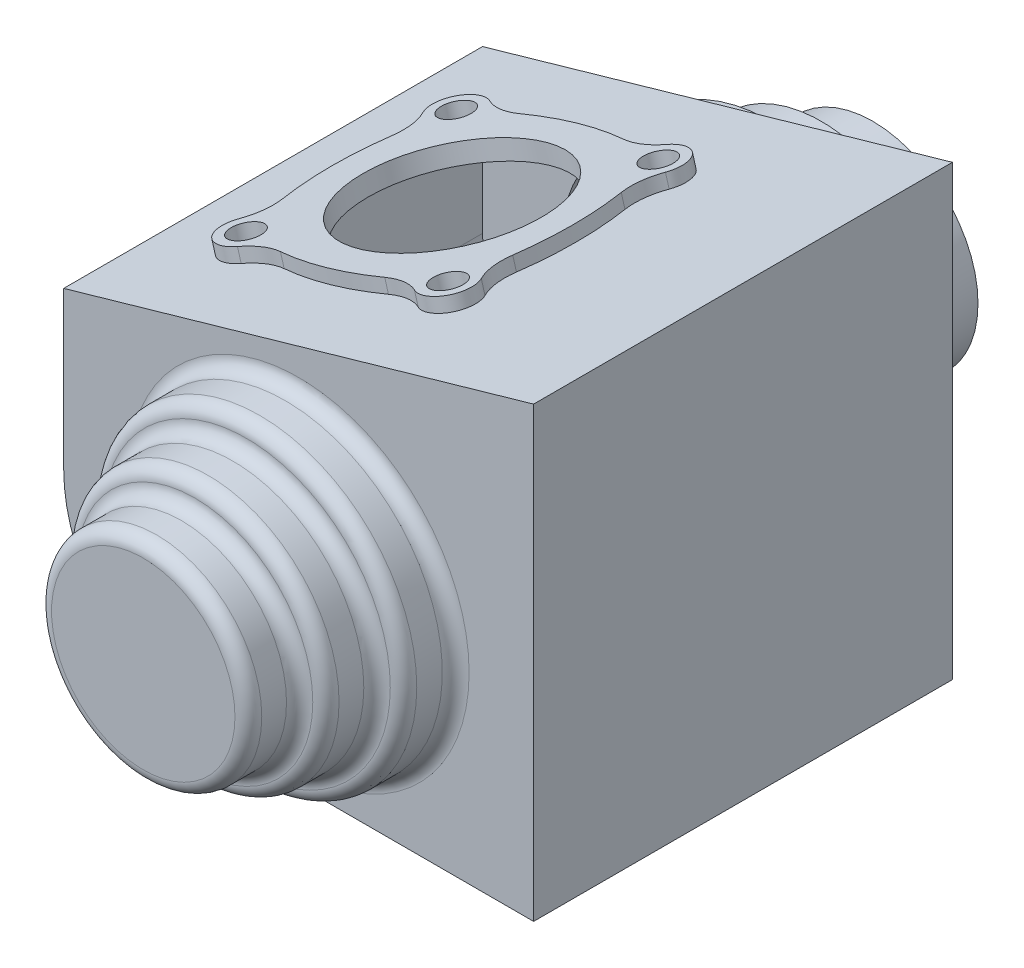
ISO-10303-21;
HEADER;
FILE_DESCRIPTION(('STEP AP214'),'2;1');
FILE_NAME('part.step','',(''),(''),'','','');
FILE_SCHEMA(('AUTOMOTIVE_DESIGN { 1 0 10303 214 1 1 1 1 }'));
ENDSEC;
DATA;
#1=APPLICATION_CONTEXT('core data for automotive mechanical design processes');
#2=APPLICATION_PROTOCOL_DEFINITION('international standard','automotive_design',2000,#1);
#3=PRODUCT_CONTEXT('',#1,'mechanical');
#4=PRODUCT('Part','Part','',(#3));
#5=PRODUCT_RELATED_PRODUCT_CATEGORY('part','',(#4));
#6=PRODUCT_DEFINITION_FORMATION('','',#4);
#7=PRODUCT_DEFINITION_CONTEXT('part definition',#1,'design');
#8=PRODUCT_DEFINITION('design','',#6,#7);
#9=PRODUCT_DEFINITION_SHAPE('','',#8);
#10=(LENGTH_UNIT() NAMED_UNIT(*) SI_UNIT(.MILLI.,.METRE.));
#11=(NAMED_UNIT(*) PLANE_ANGLE_UNIT() SI_UNIT($,.RADIAN.));
#12=(NAMED_UNIT(*) SI_UNIT($,.STERADIAN.) SOLID_ANGLE_UNIT());
#13=UNCERTAINTY_MEASURE_WITH_UNIT(LENGTH_MEASURE(1.E-05),#10,'distance_accuracy_value','');
#14=(GEOMETRIC_REPRESENTATION_CONTEXT(3) GLOBAL_UNCERTAINTY_ASSIGNED_CONTEXT((#13)) GLOBAL_UNIT_ASSIGNED_CONTEXT((#10,
#11,#12)) REPRESENTATION_CONTEXT('',''));
#15=CARTESIAN_POINT('',(0.,0.,0.));
#16=DIRECTION('',(0.,0.,1.));
#17=DIRECTION('',(1.,0.,0.));
#18=AXIS2_PLACEMENT_3D('',#15,#16,#17);
#19=CARTESIAN_POINT('',(114.,128.377947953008,101.6));
#20=DIRECTION('',(0.275637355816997,-0.96126169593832,0.));
#21=DIRECTION('',(0.96126169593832,0.275637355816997,0.));
#22=AXIS2_PLACEMENT_3D('',#19,#20,#21);
#23=PLANE('',#22);
#24=DIRECTION('',(-0.96126169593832,-0.275637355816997,0.));
#25=VECTOR('',#24,1.);
#26=CARTESIAN_POINT('',(114.,128.377947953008,-101.6));
#27=LINE('',#26,#25);
#28=CARTESIAN_POINT('',(114.,128.377947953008,-101.6));
#29=VERTEX_POINT('',#28);
#30=CARTESIAN_POINT('',(-114.,63.,-101.6));
#31=VERTEX_POINT('',#30);
#32=EDGE_CURVE('E260',#29,#31,#27,.T.);
#33=ORIENTED_EDGE('',*,*,#32,.T.);
#34=DIRECTION('',(0.,0.,-1.));
#35=VECTOR('',#34,1.);
#36=CARTESIAN_POINT('',(-114.,63.,101.6));
#37=LINE('',#36,#35);
#38=CARTESIAN_POINT('',(-114.,63.,101.6));
#39=VERTEX_POINT('',#38);
#40=EDGE_CURVE('E275',#39,#31,#37,.T.);
#41=ORIENTED_EDGE('',*,*,#40,.F.);
#42=DIRECTION('',(-0.96126169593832,-0.275637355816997,0.));
#43=VECTOR('',#42,1.);
#44=CARTESIAN_POINT('',(114.,128.377947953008,101.6));
#45=LINE('',#44,#43);
#46=CARTESIAN_POINT('',(114.,128.377947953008,101.6));
#47=VERTEX_POINT('',#46);
#48=EDGE_CURVE('E248',#47,#39,#45,.T.);
#49=ORIENTED_EDGE('',*,*,#48,.F.);
#50=DIRECTION('',(0.,0.,-1.));
#51=VECTOR('',#50,1.);
#52=CARTESIAN_POINT('',(114.,128.377947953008,101.6));
#53=LINE('',#52,#51);
#54=EDGE_CURVE('E278',#47,#29,#53,.T.);
#55=ORIENTED_EDGE('',*,*,#54,.T.);
#56=EDGE_LOOP('',(#33,#41,#49,#55));
#57=FACE_BOUND('',#56,.T.);
#58=CARTESIAN_POINT('',(-55.6334587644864,79.7363363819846,-82.4443953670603));
#59=DIRECTION('',(0.275637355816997,-0.96126169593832,0.));
#60=DIRECTION('',(0.96126169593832,0.275637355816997,0.));
#61=AXIS2_PLACEMENT_3D('',#58,#59,#60);
#62=CIRCLE('',#61,25.);
#63=CARTESIAN_POINT('',(-50.6532378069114,81.1643917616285,-57.9871253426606));
#64=VERTEX_POINT('',#63);
#65=CARTESIAN_POINT('',(-68.2987311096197,76.104627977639,-61.1981822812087));
#66=VERTEX_POINT('',#65);
#67=EDGE_CURVE('E229',#64,#66,#62,.T.);
#68=ORIENTED_EDGE('',*,*,#67,.F.);
#69=CARTESIAN_POINT('',(-25.3537153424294,88.41891309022,66.2558063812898));
#70=DIRECTION('',(-0.275637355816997,0.96126169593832,0.));
#71=DIRECTION('',(0.96126169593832,0.275637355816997,0.));
#72=AXIS2_PLACEMENT_3D('',#69,#70,#71);
#73=CIRCLE('',#72,127.);
#74=CARTESIAN_POINT('',(-0.054192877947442,95.6734344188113,-57.9871253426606));
#75=VERTEX_POINT('',#74);
#76=EDGE_CURVE('E226',#75,#64,#73,.T.);
#77=ORIENTED_EDGE('',*,*,#76,.F.);
#78=CARTESIAN_POINT('',(4.92602807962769,97.1014897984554,-82.4443953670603));
#79=DIRECTION('',(0.275637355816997,-0.96126169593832,0.));
#80=DIRECTION('',(-0.96126169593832,-0.275637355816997,0.));
#81=AXIS2_PLACEMENT_3D('',#78,#79,#80);
#82=CIRCLE('',#81,25.);
#83=CARTESIAN_POINT('',(17.591300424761,100.733198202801,-61.1981822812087));
#84=VERTEX_POINT('',#83);
#85=EDGE_CURVE('E1105',#84,#75,#82,.T.);
#86=ORIENTED_EDGE('',*,*,#85,.F.);
#87=CARTESIAN_POINT('',(23.6706311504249,102.476418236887,-51.));
#88=DIRECTION('',(-0.275637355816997,0.96126169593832,0.));
#89=DIRECTION('',(-0.96126169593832,-0.275637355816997,0.));
#90=AXIS2_PLACEMENT_3D('',#87,#88,#89);
#91=CIRCLE('',#90,12.);
#92=CARTESIAN_POINT('',(33.4737531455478,105.287418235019,-44.6756756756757));
#93=VERTEX_POINT('',#92);
#94=EDGE_CURVE('E1108',#93,#84,#91,.T.);
#95=ORIENTED_EDGE('',*,*,#94,.F.);
#96=CARTESIAN_POINT('',(53.8969239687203,111.143668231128,-31.5));
#97=DIRECTION('',(0.275637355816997,-0.96126169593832,0.));
#98=DIRECTION('',(0.96126169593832,0.275637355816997,0.));
#99=AXIS2_PLACEMENT_3D('',#96,#97,#98);
#100=CIRCLE('',#99,25.);
#101=CARTESIAN_POINT('',(30.3870871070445,104.4023309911,-26.3190789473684));
#102=VERTEX_POINT('',#101);
#103=EDGE_CURVE('E1111',#102,#93,#100,.T.);
#104=ORIENTED_EDGE('',*,*,#103,.F.);
#105=CARTESIAN_POINT('',(-89.0428841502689,70.1563378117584,0.));
#106=DIRECTION('',(-0.275637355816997,0.96126169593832,0.));
#107=DIRECTION('',(0.96126169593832,0.275637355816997,0.));
#108=AXIS2_PLACEMENT_3D('',#105,#106,#107);
#109=CIRCLE('',#108,127.);
#110=CARTESIAN_POINT('',(30.3870871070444,104.4023309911,26.3190789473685));
#111=VERTEX_POINT('',#110);
#112=EDGE_CURVE('E1114',#111,#102,#109,.T.);
#113=ORIENTED_EDGE('',*,*,#112,.F.);
#114=CARTESIAN_POINT('',(53.8969239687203,111.143668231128,31.5));
#115=DIRECTION('',(0.275637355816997,-0.96126169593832,0.));
#116=DIRECTION('',(-0.96126169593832,-0.275637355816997,0.));
#117=AXIS2_PLACEMENT_3D('',#114,#115,#116);
#118=CIRCLE('',#117,25.);
#119=CARTESIAN_POINT('',(33.4737531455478,105.287418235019,44.6756756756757));
#120=VERTEX_POINT('',#119);
#121=EDGE_CURVE('E1117',#120,#111,#118,.T.);
#122=ORIENTED_EDGE('',*,*,#121,.F.);
#123=CARTESIAN_POINT('',(23.6706311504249,102.476418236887,51.));
#124=DIRECTION('',(-0.275637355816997,0.96126169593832,0.));
#125=DIRECTION('',(-0.96126169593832,-0.275637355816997,0.));
#126=AXIS2_PLACEMENT_3D('',#123,#124,#125);
#127=CIRCLE('',#126,12.);
#128=CARTESIAN_POINT('',(17.591300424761,100.733198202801,61.1981822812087));
#129=VERTEX_POINT('',#128);
#130=EDGE_CURVE('E1120',#129,#120,#127,.T.);
#131=ORIENTED_EDGE('',*,*,#130,.F.);
#132=CARTESIAN_POINT('',(4.92602807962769,97.1014897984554,82.4443953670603));
#133=DIRECTION('',(0.275637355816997,-0.96126169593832,0.));
#134=DIRECTION('',(0.96126169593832,0.275637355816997,0.));
#135=AXIS2_PLACEMENT_3D('',#132,#133,#134);
#136=CIRCLE('',#135,25.);
#137=CARTESIAN_POINT('',(-0.0541928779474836,95.6734344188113,57.9871253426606));
#138=VERTEX_POINT('',#137);
#139=EDGE_CURVE('E1123',#138,#129,#136,.T.);
#140=ORIENTED_EDGE('',*,*,#139,.F.);
#141=CARTESIAN_POINT('',(-25.3537153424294,88.41891309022,-66.2558063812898));
#142=DIRECTION('',(-0.275637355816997,0.96126169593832,0.));
#143=DIRECTION('',(-0.96126169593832,-0.275637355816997,0.));
#144=AXIS2_PLACEMENT_3D('',#141,#142,#143);
#145=CIRCLE('',#144,127.);
#146=CARTESIAN_POINT('',(-50.6532378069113,81.1643917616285,57.9871253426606));
#147=VERTEX_POINT('',#146);
#148=EDGE_CURVE('E1126',#147,#138,#145,.T.);
#149=ORIENTED_EDGE('',*,*,#148,.F.);
#150=CARTESIAN_POINT('',(-55.6334587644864,79.7363363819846,82.4443953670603));
#151=DIRECTION('',(0.275637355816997,-0.96126169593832,0.));
#152=DIRECTION('',(-0.96126169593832,-0.275637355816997,0.));
#153=AXIS2_PLACEMENT_3D('',#150,#151,#152);
#154=CIRCLE('',#153,25.);
#155=CARTESIAN_POINT('',(-68.2987311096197,76.104627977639,61.1981822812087));
#156=VERTEX_POINT('',#155);
#157=EDGE_CURVE('E1129',#156,#147,#154,.T.);
#158=ORIENTED_EDGE('',*,*,#157,.F.);
#159=CARTESIAN_POINT('',(-74.3780618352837,74.3614079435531,51.));
#160=DIRECTION('',(-0.275637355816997,0.96126169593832,0.));
#161=DIRECTION('',(-0.96126169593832,-0.275637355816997,0.));
#162=AXIS2_PLACEMENT_3D('',#159,#160,#161);
#163=CIRCLE('',#162,12.);
#164=CARTESIAN_POINT('',(-84.1811838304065,71.550407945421,44.6756756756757));
#165=VERTEX_POINT('',#164);
#166=EDGE_CURVE('E1132',#165,#156,#163,.T.);
#167=ORIENTED_EDGE('',*,*,#166,.F.);
#168=CARTESIAN_POINT('',(-104.604354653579,65.6941579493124,31.5));
#169=DIRECTION('',(0.275637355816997,-0.96126169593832,0.));
#170=DIRECTION('',(0.96126169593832,0.275637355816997,0.));
#171=AXIS2_PLACEMENT_3D('',#168,#169,#170);
#172=CIRCLE('',#171,25.);
#173=CARTESIAN_POINT('',(-81.0945177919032,72.4354951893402,26.3190789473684));
#174=VERTEX_POINT('',#173);
#175=EDGE_CURVE('E1135',#174,#165,#172,.T.);
#176=ORIENTED_EDGE('',*,*,#175,.F.);
#177=CARTESIAN_POINT('',(38.3354534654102,106.681488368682,0.));
#178=DIRECTION('',(-0.275637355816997,0.96126169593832,0.));
#179=DIRECTION('',(0.96126169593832,0.275637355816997,0.));
#180=AXIS2_PLACEMENT_3D('',#177,#178,#179);
#181=CIRCLE('',#180,127.);
#182=CARTESIAN_POINT('',(-81.0945177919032,72.4354951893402,-26.3190789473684));
#183=VERTEX_POINT('',#182);
#184=EDGE_CURVE('E1059',#183,#174,#181,.T.);
#185=ORIENTED_EDGE('',*,*,#184,.F.);
#186=CARTESIAN_POINT('',(-104.604354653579,65.6941579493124,-31.5));
#187=DIRECTION('',(0.275637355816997,-0.96126169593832,0.));
#188=DIRECTION('',(-0.96126169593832,-0.275637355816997,0.));
#189=AXIS2_PLACEMENT_3D('',#186,#187,#188);
#190=CIRCLE('',#189,25.);
#191=CARTESIAN_POINT('',(-84.1811838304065,71.550407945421,-44.6756756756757));
#192=VERTEX_POINT('',#191);
#193=EDGE_CURVE('E56',#192,#183,#190,.T.);
#194=ORIENTED_EDGE('',*,*,#193,.F.);
#195=CARTESIAN_POINT('',(-74.3780618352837,74.3614079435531,-51.));
#196=DIRECTION('',(-0.275637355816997,0.96126169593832,0.));
#197=DIRECTION('',(-0.96126169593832,-0.275637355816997,0.));
#198=AXIS2_PLACEMENT_3D('',#195,#196,#197);
#199=CIRCLE('',#198,12.);
#200=EDGE_CURVE('E51',#66,#192,#199,.T.);
#201=ORIENTED_EDGE('',*,*,#200,.F.);
#202=EDGE_LOOP('',(#68,#77,#86,#95,#104,#113,#122,#131,#140,#149,#158,#167,#176,#185,#194,#201));
#203=FACE_BOUND('',#202,.T.);
#204=ADVANCED_FACE('F36',(#57,#203),#23,.F.);
#205=CARTESIAN_POINT('',(-38.,-13.,101.6));
#206=DIRECTION('',(0.,0.,-1.));
#207=DIRECTION('',(-1.,0.,0.));
#208=AXIS2_PLACEMENT_3D('',#205,#206,#207);
#209=PLANE('',#208);
#210=CARTESIAN_POINT('',(0.,-0.100000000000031,101.6));
#211=DIRECTION('',(0.,0.,-1.));
#212=DIRECTION('',(-1.,0.,0.));
#213=AXIS2_PLACEMENT_3D('',#210,#211,#212);
#214=CIRCLE('',#213,82.7);
#215=CARTESIAN_POINT('',(-82.7,-0.100000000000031,101.6));
#216=VERTEX_POINT('',#215);
#217=EDGE_CURVE('E378',#216,#216,#214,.T.);
#218=ORIENTED_EDGE('',*,*,#217,.T.);
#219=EDGE_LOOP('',(#218));
#220=FACE_BOUND('',#219,.T.);
#221=DIRECTION('',(0.,1.,0.));
#222=VECTOR('',#221,1.);
#223=CARTESIAN_POINT('',(114.,-89.,101.6));
#224=LINE('',#223,#222);
#225=CARTESIAN_POINT('',(114.,-89.,101.6));
#226=VERTEX_POINT('',#225);
#227=EDGE_CURVE('E245',#226,#47,#224,.T.);
#228=ORIENTED_EDGE('',*,*,#227,.T.);
#229=ORIENTED_EDGE('',*,*,#48,.T.);
#230=DIRECTION('',(0.,-1.,0.));
#231=VECTOR('',#230,1.);
#232=CARTESIAN_POINT('',(-114.,63.,101.6));
#233=LINE('',#232,#231);
#234=CARTESIAN_POINT('',(-114.,-13.,101.6));
#235=VERTEX_POINT('',#234);
#236=EDGE_CURVE('E251',#39,#235,#233,.T.);
#237=ORIENTED_EDGE('',*,*,#236,.T.);
#238=CARTESIAN_POINT('',(-38.,-13.,101.6));
#239=DIRECTION('',(0.,0.,1.));
#240=DIRECTION('',(-1.,0.,0.));
#241=AXIS2_PLACEMENT_3D('',#238,#239,#240);
#242=CIRCLE('',#241,76.);
#243=CARTESIAN_POINT('',(-38.,-89.,101.6));
#244=VERTEX_POINT('',#243);
#245=EDGE_CURVE('E253',#235,#244,#242,.T.);
#246=ORIENTED_EDGE('',*,*,#245,.T.);
#247=DIRECTION('',(1.,0.,0.));
#248=VECTOR('',#247,1.);
#249=CARTESIAN_POINT('',(-38.,-89.,101.6));
#250=LINE('',#249,#248);
#251=EDGE_CURVE('E255',#244,#226,#250,.T.);
#252=ORIENTED_EDGE('',*,*,#251,.T.);
#253=EDGE_LOOP('',(#228,#229,#237,#246,#252));
#254=FACE_BOUND('',#253,.T.);
#255=ADVANCED_FACE('F402',(#220,#254),#209,.F.);
#256=CARTESIAN_POINT('',(114.,-89.,101.6));
#257=DIRECTION('',(-1.,0.,0.));
#258=DIRECTION('',(0.,-1.,0.));
#259=AXIS2_PLACEMENT_3D('',#256,#257,#258);
#260=PLANE('',#259);
#261=DIRECTION('',(0.,1.,0.));
#262=VECTOR('',#261,1.);
#263=CARTESIAN_POINT('',(114.,-89.,-101.6));
#264=LINE('',#263,#262);
#265=CARTESIAN_POINT('',(114.,-89.,-101.6));
#266=VERTEX_POINT('',#265);
#267=EDGE_CURVE('E244',#266,#29,#264,.T.);
#268=ORIENTED_EDGE('',*,*,#267,.T.);
#269=ORIENTED_EDGE('',*,*,#54,.F.);
#270=ORIENTED_EDGE('',*,*,#227,.F.);
#271=DIRECTION('',(0.,0.,-1.));
#272=VECTOR('',#271,1.);
#273=CARTESIAN_POINT('',(114.,-89.,101.6));
#274=LINE('',#273,#272);
#275=EDGE_CURVE('E257',#226,#266,#274,.T.);
#276=ORIENTED_EDGE('',*,*,#275,.T.);
#277=EDGE_LOOP('',(#268,#269,#270,#276));
#278=FACE_BOUND('',#277,.T.);
#279=ADVANCED_FACE('F408',(#278),#260,.F.);
#280=CARTESIAN_POINT('',(-114.,63.,101.6));
#281=DIRECTION('',(1.,0.,0.));
#282=DIRECTION('',(0.,1.,0.));
#283=AXIS2_PLACEMENT_3D('',#280,#281,#282);
#284=PLANE('',#283);
#285=DIRECTION('',(0.,-1.,0.));
#286=VECTOR('',#285,1.);
#287=CARTESIAN_POINT('',(-114.,63.,-101.6));
#288=LINE('',#287,#286);
#289=CARTESIAN_POINT('',(-114.,-13.,-101.6));
#290=VERTEX_POINT('',#289);
#291=EDGE_CURVE('E262',#31,#290,#288,.T.);
#292=ORIENTED_EDGE('',*,*,#291,.T.);
#293=DIRECTION('',(0.,0.,-1.));
#294=VECTOR('',#293,1.);
#295=CARTESIAN_POINT('',(-114.,-13.,101.6));
#296=LINE('',#295,#294);
#297=EDGE_CURVE('E272',#235,#290,#296,.T.);
#298=ORIENTED_EDGE('',*,*,#297,.F.);
#299=ORIENTED_EDGE('',*,*,#236,.F.);
#300=ORIENTED_EDGE('',*,*,#40,.T.);
#301=EDGE_LOOP('',(#292,#298,#299,#300));
#302=FACE_BOUND('',#301,.T.);
#303=ADVANCED_FACE('F413',(#302),#284,.F.);
#304=CARTESIAN_POINT('',(-38.,-13.,101.6));
#305=DIRECTION('',(0.,0.,-1.));
#306=DIRECTION('',(-1.,0.,0.));
#307=AXIS2_PLACEMENT_3D('',#304,#305,#306);
#308=CYLINDRICAL_SURFACE('',#307,76.);
#309=CARTESIAN_POINT('',(-38.,-13.,-101.6));
#310=DIRECTION('',(0.,0.,1.));
#311=DIRECTION('',(-1.,0.,0.));
#312=AXIS2_PLACEMENT_3D('',#309,#310,#311);
#313=CIRCLE('',#312,76.);
#314=CARTESIAN_POINT('',(-38.,-89.,-101.6));
#315=VERTEX_POINT('',#314);
#316=EDGE_CURVE('E264',#290,#315,#313,.T.);
#317=ORIENTED_EDGE('',*,*,#316,.T.);
#318=DIRECTION('',(0.,0.,-1.));
#319=VECTOR('',#318,1.);
#320=CARTESIAN_POINT('',(-38.,-89.,101.6));
#321=LINE('',#320,#319);
#322=EDGE_CURVE('E269',#244,#315,#321,.T.);
#323=ORIENTED_EDGE('',*,*,#322,.F.);
#324=ORIENTED_EDGE('',*,*,#245,.F.);
#325=ORIENTED_EDGE('',*,*,#297,.T.);
#326=EDGE_LOOP('',(#317,#323,#324,#325));
#327=FACE_BOUND('',#326,.T.);
#328=ADVANCED_FACE('F537',(#327),#308,.T.);
#329=CARTESIAN_POINT('',(-38.,-89.,101.6));
#330=DIRECTION('',(0.,1.,0.));
#331=DIRECTION('',(0.,0.,1.));
#332=AXIS2_PLACEMENT_3D('',#329,#330,#331);
#333=PLANE('',#332);
#334=DIRECTION('',(1.,0.,0.));
#335=VECTOR('',#334,1.);
#336=CARTESIAN_POINT('',(-38.,-89.,-101.6));
#337=LINE('',#336,#335);
#338=EDGE_CURVE('E249',#315,#266,#337,.T.);
#339=ORIENTED_EDGE('',*,*,#338,.T.);
#340=ORIENTED_EDGE('',*,*,#275,.F.);
#341=ORIENTED_EDGE('',*,*,#251,.F.);
#342=ORIENTED_EDGE('',*,*,#322,.T.);
#343=EDGE_LOOP('',(#339,#340,#341,#342));
#344=FACE_BOUND('',#343,.T.);
#345=ADVANCED_FACE('F531',(#344),#333,.F.);
#346=CARTESIAN_POINT('',(-38.,-13.,-101.6));
#347=DIRECTION('',(0.,0.,-1.));
#348=DIRECTION('',(-1.,0.,0.));
#349=AXIS2_PLACEMENT_3D('',#346,#347,#348);
#350=PLANE('',#349);
#351=CARTESIAN_POINT('',(0.,-0.100000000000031,-101.6));
#352=DIRECTION('',(0.,0.,-1.));
#353=DIRECTION('',(-1.,0.,0.));
#354=AXIS2_PLACEMENT_3D('',#351,#352,#353);
#355=CIRCLE('',#354,76.2);
#356=CARTESIAN_POINT('',(-76.2,-0.100000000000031,-101.6));
#357=VERTEX_POINT('',#356);
#358=EDGE_CURVE('E281',#357,#357,#355,.T.);
#359=ORIENTED_EDGE('',*,*,#358,.F.);
#360=EDGE_LOOP('',(#359));
#361=FACE_BOUND('',#360,.T.);
#362=ORIENTED_EDGE('',*,*,#267,.F.);
#363=ORIENTED_EDGE('',*,*,#338,.F.);
#364=ORIENTED_EDGE('',*,*,#316,.F.);
#365=ORIENTED_EDGE('',*,*,#291,.F.);
#366=ORIENTED_EDGE('',*,*,#32,.F.);
#367=EDGE_LOOP('',(#362,#363,#364,#365,#366));
#368=FACE_BOUND('',#367,.T.);
#369=ADVANCED_FACE('F521',(#361,#368),#350,.T.);
#370=CARTESIAN_POINT('',(0.,-0.100000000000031,127.));
#371=DIRECTION('',(0.,0.,-1.));
#372=DIRECTION('',(-1.,0.,0.));
#373=AXIS2_PLACEMENT_3D('',#370,#371,#372);
#374=CYLINDRICAL_SURFACE('',#373,76.2);
#375=CARTESIAN_POINT('',(0.,-0.100000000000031,108.1));
#376=DIRECTION('',(0.,0.,-1.));
#377=DIRECTION('',(-1.,0.,0.));
#378=AXIS2_PLACEMENT_3D('',#375,#376,#377);
#379=CIRCLE('',#378,76.2);
#380=CARTESIAN_POINT('',(-76.2,-0.100000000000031,108.1));
#381=VERTEX_POINT('',#380);
#382=EDGE_CURVE('E375',#381,#381,#379,.F.);
#383=ORIENTED_EDGE('',*,*,#382,.T.);
#384=EDGE_LOOP('',(#383));
#385=FACE_BOUND('',#384,.T.);
#386=CARTESIAN_POINT('',(0.,-0.100000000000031,120.5));
#387=DIRECTION('',(0.,0.,1.));
#388=DIRECTION('',(1.,0.,0.));
#389=AXIS2_PLACEMENT_3D('',#386,#387,#388);
#390=CIRCLE('',#389,76.2);
#391=CARTESIAN_POINT('',(76.2,-0.100000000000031,120.5));
#392=VERTEX_POINT('',#391);
#393=EDGE_CURVE('E294',#392,#392,#390,.F.);
#394=ORIENTED_EDGE('',*,*,#393,.T.);
#395=EDGE_LOOP('',(#394));
#396=FACE_BOUND('',#395,.T.);
#397=ADVANCED_FACE('F517',(#385,#396),#374,.T.);
#398=CARTESIAN_POINT('',(0.,-0.100000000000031,152.));
#399=DIRECTION('',(0.,0.,-1.));
#400=DIRECTION('',(-1.,0.,0.));
#401=AXIS2_PLACEMENT_3D('',#398,#399,#400);
#402=CYLINDRICAL_SURFACE('',#401,63.5);
#403=CARTESIAN_POINT('',(0.,-0.100000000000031,133.49653800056));
#404=DIRECTION('',(0.,0.,1.));
#405=DIRECTION('',(1.,0.,0.));
#406=AXIS2_PLACEMENT_3D('',#403,#404,#405);
#407=CIRCLE('',#406,63.5);
#408=CARTESIAN_POINT('',(63.5,-0.100000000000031,133.49653800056));
#409=VERTEX_POINT('',#408);
#410=EDGE_CURVE('E381',#409,#409,#407,.T.);
#411=ORIENTED_EDGE('',*,*,#410,.T.);
#412=EDGE_LOOP('',(#411));
#413=FACE_BOUND('',#412,.T.);
#414=CARTESIAN_POINT('',(0.,-0.100000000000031,145.5));
#415=DIRECTION('',(0.,0.,1.));
#416=DIRECTION('',(1.,0.,0.));
#417=AXIS2_PLACEMENT_3D('',#414,#415,#416);
#418=CIRCLE('',#417,63.5);
#419=CARTESIAN_POINT('',(63.5,-0.100000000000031,145.5));
#420=VERTEX_POINT('',#419);
#421=EDGE_CURVE('E366',#420,#420,#418,.F.);
#422=ORIENTED_EDGE('',*,*,#421,.T.);
#423=EDGE_LOOP('',(#422));
#424=FACE_BOUND('',#423,.T.);
#425=ADVANCED_FACE('F520',(#413,#424),#402,.T.);
#426=CARTESIAN_POINT('',(0.,-0.100000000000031,177.));
#427=DIRECTION('',(0.,0.,-1.));
#428=DIRECTION('',(-1.,0.,0.));
#429=AXIS2_PLACEMENT_3D('',#426,#427,#428);
#430=CYLINDRICAL_SURFACE('',#429,51.);
#431=CARTESIAN_POINT('',(0.,-0.100000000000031,158.490381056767));
#432=DIRECTION('',(0.,0.,1.));
#433=DIRECTION('',(1.,0.,0.));
#434=AXIS2_PLACEMENT_3D('',#431,#432,#433);
#435=CIRCLE('',#434,51.);
#436=CARTESIAN_POINT('',(51.,-0.100000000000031,158.490381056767));
#437=VERTEX_POINT('',#436);
#438=EDGE_CURVE('E44',#437,#437,#435,.T.);
#439=ORIENTED_EDGE('',*,*,#438,.T.);
#440=EDGE_LOOP('',(#439));
#441=FACE_BOUND('',#440,.T.);
#442=CARTESIAN_POINT('',(0.,-0.100000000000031,170.5));
#443=DIRECTION('',(0.,0.,1.));
#444=DIRECTION('',(1.,0.,0.));
#445=AXIS2_PLACEMENT_3D('',#442,#443,#444);
#446=CIRCLE('',#445,51.);
#447=CARTESIAN_POINT('',(51.,-0.100000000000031,170.5));
#448=VERTEX_POINT('',#447);
#449=EDGE_CURVE('E372',#448,#448,#446,.F.);
#450=ORIENTED_EDGE('',*,*,#449,.T.);
#451=EDGE_LOOP('',(#450));
#452=FACE_BOUND('',#451,.T.);
#453=ADVANCED_FACE('F389',(#441,#452),#430,.T.);
#454=CARTESIAN_POINT('',(0.,-0.100000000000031,177.));
#455=DIRECTION('',(0.,0.,1.));
#456=DIRECTION('',(1.,0.,0.));
#457=AXIS2_PLACEMENT_3D('',#454,#455,#456);
#458=PLANE('',#457);
#459=CARTESIAN_POINT('',(0.,-0.100000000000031,177.));
#460=DIRECTION('',(0.,0.,1.));
#461=DIRECTION('',(1.,0.,0.));
#462=AXIS2_PLACEMENT_3D('',#459,#460,#461);
#463=CIRCLE('',#462,44.5);
#464=CARTESIAN_POINT('',(44.5,-0.100000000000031,177.));
#465=VERTEX_POINT('',#464);
#466=EDGE_CURVE('E369',#465,#465,#463,.T.);
#467=ORIENTED_EDGE('',*,*,#466,.T.);
#468=EDGE_LOOP('',(#467));
#469=FACE_BOUND('',#468,.T.);
#470=ADVANCED_FACE('F594',(#469),#458,.T.);
#471=CARTESIAN_POINT('',(0.,-0.100000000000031,-127.));
#472=DIRECTION('',(0.,0.,1.));
#473=DIRECTION('',(1.,0.,0.));
#474=AXIS2_PLACEMENT_3D('',#471,#472,#473);
#475=CYLINDRICAL_SURFACE('',#474,76.2);
#476=CARTESIAN_POINT('',(0.,-0.100000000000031,-127.));
#477=DIRECTION('',(0.,0.,1.));
#478=DIRECTION('',(1.,0.,0.));
#479=AXIS2_PLACEMENT_3D('',#476,#477,#478);
#480=CIRCLE('',#479,76.2);
#481=CARTESIAN_POINT('',(76.2,-0.100000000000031,-127.));
#482=VERTEX_POINT('',#481);
#483=EDGE_CURVE('E241',#482,#482,#480,.T.);
#484=ORIENTED_EDGE('',*,*,#483,.T.);
#485=EDGE_LOOP('',(#484));
#486=FACE_BOUND('',#485,.T.);
#487=ORIENTED_EDGE('',*,*,#358,.T.);
#488=EDGE_LOOP('',(#487));
#489=FACE_BOUND('',#488,.T.);
#490=ADVANCED_FACE('F909',(#486,#489),#475,.T.);
#491=CARTESIAN_POINT('',(0.,-0.100000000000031,-127.));
#492=DIRECTION('',(0.,0.,-1.));
#493=DIRECTION('',(1.,0.,0.));
#494=AXIS2_PLACEMENT_3D('',#491,#492,#493);
#495=PLANE('',#494);
#496=CARTESIAN_POINT('',(0.,-0.100000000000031,-127.));
#497=DIRECTION('',(0.,0.,-1.));
#498=DIRECTION('',(-1.,0.,0.));
#499=AXIS2_PLACEMENT_3D('',#496,#497,#498);
#500=CIRCLE('',#499,63.5);
#501=CARTESIAN_POINT('',(-63.5,-0.100000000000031,-127.));
#502=VERTEX_POINT('',#501);
#503=EDGE_CURVE('E284',#502,#502,#500,.T.);
#504=ORIENTED_EDGE('',*,*,#503,.F.);
#505=EDGE_LOOP('',(#504));
#506=FACE_BOUND('',#505,.T.);
#507=ORIENTED_EDGE('',*,*,#483,.F.);
#508=EDGE_LOOP('',(#507));
#509=FACE_BOUND('',#508,.T.);
#510=ADVANCED_FACE('F901',(#506,#509),#495,.T.);
#511=CARTESIAN_POINT('',(0.,-0.100000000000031,-152.));
#512=DIRECTION('',(0.,0.,1.));
#513=DIRECTION('',(1.,0.,0.));
#514=AXIS2_PLACEMENT_3D('',#511,#512,#513);
#515=CYLINDRICAL_SURFACE('',#514,63.5);
#516=CARTESIAN_POINT('',(0.,-0.100000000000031,-152.));
#517=DIRECTION('',(0.,0.,1.));
#518=DIRECTION('',(1.,0.,0.));
#519=AXIS2_PLACEMENT_3D('',#516,#517,#518);
#520=CIRCLE('',#519,63.5);
#521=CARTESIAN_POINT('',(63.5,-0.100000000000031,-152.));
#522=VERTEX_POINT('',#521);
#523=EDGE_CURVE('E233',#522,#522,#520,.T.);
#524=ORIENTED_EDGE('',*,*,#523,.T.);
#525=EDGE_LOOP('',(#524));
#526=FACE_BOUND('',#525,.T.);
#527=ORIENTED_EDGE('',*,*,#503,.T.);
#528=EDGE_LOOP('',(#527));
#529=FACE_BOUND('',#528,.T.);
#530=ADVANCED_FACE('F893',(#526,#529),#515,.T.);
#531=CARTESIAN_POINT('',(0.,-0.100000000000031,-152.));
#532=DIRECTION('',(0.,0.,-1.));
#533=DIRECTION('',(1.,0.,0.));
#534=AXIS2_PLACEMENT_3D('',#531,#532,#533);
#535=PLANE('',#534);
#536=CARTESIAN_POINT('',(0.,-0.100000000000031,-152.));
#537=DIRECTION('',(0.,0.,-1.));
#538=DIRECTION('',(-1.,0.,0.));
#539=AXIS2_PLACEMENT_3D('',#536,#537,#538);
#540=CIRCLE('',#539,51.);
#541=CARTESIAN_POINT('',(-51.,-0.100000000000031,-152.));
#542=VERTEX_POINT('',#541);
#543=EDGE_CURVE('E287',#542,#542,#540,.T.);
#544=ORIENTED_EDGE('',*,*,#543,.F.);
#545=EDGE_LOOP('',(#544));
#546=FACE_BOUND('',#545,.T.);
#547=ORIENTED_EDGE('',*,*,#523,.F.);
#548=EDGE_LOOP('',(#547));
#549=FACE_BOUND('',#548,.T.);
#550=ADVANCED_FACE('F885',(#546,#549),#535,.T.);
#551=CARTESIAN_POINT('',(0.,-0.100000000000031,-177.));
#552=DIRECTION('',(0.,0.,1.));
#553=DIRECTION('',(1.,0.,0.));
#554=AXIS2_PLACEMENT_3D('',#551,#552,#553);
#555=CYLINDRICAL_SURFACE('',#554,51.);
#556=CARTESIAN_POINT('',(0.,-0.100000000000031,-177.));
#557=DIRECTION('',(0.,0.,1.));
#558=DIRECTION('',(1.,0.,0.));
#559=AXIS2_PLACEMENT_3D('',#556,#557,#558);
#560=CIRCLE('',#559,51.);
#561=CARTESIAN_POINT('',(51.,-0.100000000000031,-177.));
#562=VERTEX_POINT('',#561);
#563=EDGE_CURVE('E230',#562,#562,#560,.T.);
#564=ORIENTED_EDGE('',*,*,#563,.T.);
#565=EDGE_LOOP('',(#564));
#566=FACE_BOUND('',#565,.T.);
#567=ORIENTED_EDGE('',*,*,#543,.T.);
#568=EDGE_LOOP('',(#567));
#569=FACE_BOUND('',#568,.T.);
#570=ADVANCED_FACE('F877',(#566,#569),#555,.T.);
#571=CARTESIAN_POINT('',(0.,-0.100000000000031,-177.));
#572=DIRECTION('',(0.,0.,-1.));
#573=DIRECTION('',(1.,0.,0.));
#574=AXIS2_PLACEMENT_3D('',#571,#572,#573);
#575=PLANE('',#574);
#576=ORIENTED_EDGE('',*,*,#563,.F.);
#577=EDGE_LOOP('',(#576));
#578=FACE_BOUND('',#577,.T.);
#579=ADVANCED_FACE('F871',(#578),#575,.T.);
#580=CARTESIAN_POINT('',(-57.4251015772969,85.9845374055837,-82.4443953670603));
#581=DIRECTION('',(0.275637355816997,-0.96126169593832,0.));
#582=DIRECTION('',(0.96126169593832,0.275637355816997,0.));
#583=AXIS2_PLACEMENT_3D('',#580,#581,#582);
#584=CYLINDRICAL_SURFACE('',#583,25.);
#585=ORIENTED_EDGE('',*,*,#67,.T.);
#586=DIRECTION('',(0.275637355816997,-0.96126169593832,0.));
#587=VECTOR('',#586,1.);
#588=CARTESIAN_POINT('',(-70.0903739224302,82.3528290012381,-61.1981822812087));
#589=LINE('',#588,#587);
#590=CARTESIAN_POINT('',(-70.0903739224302,82.3528290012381,-61.1981822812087));
#591=VERTEX_POINT('',#590);
#592=EDGE_CURVE('E210',#591,#66,#589,.T.);
#593=ORIENTED_EDGE('',*,*,#592,.F.);
#594=CARTESIAN_POINT('',(-57.4251015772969,85.9845374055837,-82.4443953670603));
#595=DIRECTION('',(0.275637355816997,-0.96126169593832,0.));
#596=DIRECTION('',(0.96126169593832,0.275637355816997,0.));
#597=AXIS2_PLACEMENT_3D('',#594,#595,#596);
#598=CIRCLE('',#597,25.);
#599=CARTESIAN_POINT('',(-52.4448806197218,87.4125927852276,-57.9871253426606));
#600=VERTEX_POINT('',#599);
#601=EDGE_CURVE('E217',#600,#591,#598,.T.);
#602=ORIENTED_EDGE('',*,*,#601,.F.);
#603=DIRECTION('',(0.275637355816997,-0.96126169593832,0.));
#604=VECTOR('',#603,1.);
#605=CARTESIAN_POINT('',(-52.4448806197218,87.4125927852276,-57.9871253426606));
#606=LINE('',#605,#604);
#607=EDGE_CURVE('E1101',#600,#64,#606,.T.);
#608=ORIENTED_EDGE('',*,*,#607,.T.);
#609=EDGE_LOOP('',(#585,#593,#602,#608));
#610=FACE_BOUND('',#609,.T.);
#611=ADVANCED_FACE('F228',(#610),#584,.F.);
#612=CARTESIAN_POINT('',(-76.1697046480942,80.6096089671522,-51.));
#613=DIRECTION('',(0.275637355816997,-0.96126169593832,0.));
#614=DIRECTION('',(0.96126169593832,0.275637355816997,0.));
#615=AXIS2_PLACEMENT_3D('',#612,#613,#614);
#616=CYLINDRICAL_SURFACE('',#615,12.);
#617=ORIENTED_EDGE('',*,*,#200,.T.);
#618=DIRECTION('',(0.275637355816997,-0.96126169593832,0.));
#619=VECTOR('',#618,1.);
#620=CARTESIAN_POINT('',(-85.972826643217,77.7986089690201,-44.6756756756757));
#621=LINE('',#620,#619);
#622=CARTESIAN_POINT('',(-85.972826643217,77.7986089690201,-44.6756756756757));
#623=VERTEX_POINT('',#622);
#624=EDGE_CURVE('E213',#623,#192,#621,.T.);
#625=ORIENTED_EDGE('',*,*,#624,.F.);
#626=CARTESIAN_POINT('',(-76.1697046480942,80.6096089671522,-51.));
#627=DIRECTION('',(-0.275637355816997,0.96126169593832,0.));
#628=DIRECTION('',(-0.96126169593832,-0.275637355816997,0.));
#629=AXIS2_PLACEMENT_3D('',#626,#627,#628);
#630=CIRCLE('',#629,12.);
#631=EDGE_CURVE('E206',#591,#623,#630,.T.);
#632=ORIENTED_EDGE('',*,*,#631,.F.);
#633=ORIENTED_EDGE('',*,*,#592,.T.);
#634=EDGE_LOOP('',(#617,#625,#632,#633));
#635=FACE_BOUND('',#634,.T.);
#636=ADVANCED_FACE('F208',(#635),#616,.T.);
#637=CARTESIAN_POINT('',(-106.39599746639,71.9423589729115,-31.5));
#638=DIRECTION('',(0.275637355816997,-0.96126169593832,0.));
#639=DIRECTION('',(0.96126169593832,0.275637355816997,0.));
#640=AXIS2_PLACEMENT_3D('',#637,#638,#639);
#641=CYLINDRICAL_SURFACE('',#640,25.);
#642=ORIENTED_EDGE('',*,*,#193,.T.);
#643=DIRECTION('',(0.275637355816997,-0.96126169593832,0.));
#644=VECTOR('',#643,1.);
#645=CARTESIAN_POINT('',(-82.8861606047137,78.6836962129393,-26.3190789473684));
#646=LINE('',#645,#644);
#647=CARTESIAN_POINT('',(-82.8861606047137,78.6836962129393,-26.3190789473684));
#648=VERTEX_POINT('',#647);
#649=EDGE_CURVE('E235',#648,#183,#646,.T.);
#650=ORIENTED_EDGE('',*,*,#649,.F.);
#651=CARTESIAN_POINT('',(-106.39599746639,71.9423589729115,-31.5));
#652=DIRECTION('',(0.275637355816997,-0.96126169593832,0.));
#653=DIRECTION('',(-0.96126169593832,-0.275637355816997,0.));
#654=AXIS2_PLACEMENT_3D('',#651,#652,#653);
#655=CIRCLE('',#654,25.);
#656=EDGE_CURVE('E216',#623,#648,#655,.T.);
#657=ORIENTED_EDGE('',*,*,#656,.F.);
#658=ORIENTED_EDGE('',*,*,#624,.T.);
#659=EDGE_LOOP('',(#642,#650,#657,#658));
#660=FACE_BOUND('',#659,.T.);
#661=ADVANCED_FACE('F850',(#660),#641,.F.);
#662=CARTESIAN_POINT('',(36.5438106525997,112.929689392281,0.));
#663=DIRECTION('',(0.275637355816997,-0.96126169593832,0.));
#664=DIRECTION('',(0.96126169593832,0.275637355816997,0.));
#665=AXIS2_PLACEMENT_3D('',#662,#663,#664);
#666=CYLINDRICAL_SURFACE('',#665,127.);
#667=ORIENTED_EDGE('',*,*,#184,.T.);
#668=DIRECTION('',(0.275637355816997,-0.96126169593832,0.));
#669=VECTOR('',#668,1.);
#670=CARTESIAN_POINT('',(-82.8861606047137,78.6836962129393,26.3190789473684));
#671=LINE('',#670,#669);
#672=CARTESIAN_POINT('',(-82.8861606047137,78.6836962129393,26.3190789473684));
#673=VERTEX_POINT('',#672);
#674=EDGE_CURVE('E1065',#673,#174,#671,.T.);
#675=ORIENTED_EDGE('',*,*,#674,.F.);
#676=CARTESIAN_POINT('',(36.5438106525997,112.929689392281,0.));
#677=DIRECTION('',(-0.275637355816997,0.96126169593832,0.));
#678=DIRECTION('',(0.96126169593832,0.275637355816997,0.));
#679=AXIS2_PLACEMENT_3D('',#676,#677,#678);
#680=CIRCLE('',#679,127.);
#681=EDGE_CURVE('E1064',#648,#673,#680,.T.);
#682=ORIENTED_EDGE('',*,*,#681,.F.);
#683=ORIENTED_EDGE('',*,*,#649,.T.);
#684=EDGE_LOOP('',(#667,#675,#682,#683));
#685=FACE_BOUND('',#684,.T.);
#686=ADVANCED_FACE('F842',(#685),#666,.T.);
#687=CARTESIAN_POINT('',(-106.39599746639,71.9423589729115,31.5));
#688=DIRECTION('',(0.275637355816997,-0.96126169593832,0.));
#689=DIRECTION('',(0.96126169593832,0.275637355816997,0.));
#690=AXIS2_PLACEMENT_3D('',#687,#688,#689);
#691=CYLINDRICAL_SURFACE('',#690,25.);
#692=ORIENTED_EDGE('',*,*,#175,.T.);
#693=DIRECTION('',(0.275637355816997,-0.96126169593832,0.));
#694=VECTOR('',#693,1.);
#695=CARTESIAN_POINT('',(-85.972826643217,77.7986089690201,44.6756756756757));
#696=LINE('',#695,#694);
#697=CARTESIAN_POINT('',(-85.972826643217,77.7986089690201,44.6756756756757));
#698=VERTEX_POINT('',#697);
#699=EDGE_CURVE('E1066',#698,#165,#696,.T.);
#700=ORIENTED_EDGE('',*,*,#699,.F.);
#701=CARTESIAN_POINT('',(-106.39599746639,71.9423589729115,31.5));
#702=DIRECTION('',(0.275637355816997,-0.96126169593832,0.));
#703=DIRECTION('',(0.96126169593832,0.275637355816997,0.));
#704=AXIS2_PLACEMENT_3D('',#701,#702,#703);
#705=CIRCLE('',#704,25.);
#706=EDGE_CURVE('E1163',#673,#698,#705,.T.);
#707=ORIENTED_EDGE('',*,*,#706,.F.);
#708=ORIENTED_EDGE('',*,*,#674,.T.);
#709=EDGE_LOOP('',(#692,#700,#707,#708));
#710=FACE_BOUND('',#709,.T.);
#711=ADVANCED_FACE('F834',(#710),#691,.F.);
#712=CARTESIAN_POINT('',(-76.1697046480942,80.6096089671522,51.));
#713=DIRECTION('',(0.275637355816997,-0.96126169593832,0.));
#714=DIRECTION('',(0.96126169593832,0.275637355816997,0.));
#715=AXIS2_PLACEMENT_3D('',#712,#713,#714);
#716=CYLINDRICAL_SURFACE('',#715,12.);
#717=ORIENTED_EDGE('',*,*,#166,.T.);
#718=DIRECTION('',(0.275637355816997,-0.96126169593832,0.));
#719=VECTOR('',#718,1.);
#720=CARTESIAN_POINT('',(-70.0903739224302,82.3528290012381,61.1981822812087));
#721=LINE('',#720,#719);
#722=CARTESIAN_POINT('',(-70.0903739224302,82.3528290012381,61.1981822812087));
#723=VERTEX_POINT('',#722);
#724=EDGE_CURVE('E1071',#723,#156,#721,.T.);
#725=ORIENTED_EDGE('',*,*,#724,.F.);
#726=CARTESIAN_POINT('',(-76.1697046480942,80.6096089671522,51.));
#727=DIRECTION('',(-0.275637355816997,0.96126169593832,0.));
#728=DIRECTION('',(-0.96126169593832,-0.275637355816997,0.));
#729=AXIS2_PLACEMENT_3D('',#726,#727,#728);
#730=CIRCLE('',#729,12.);
#731=EDGE_CURVE('E1161',#698,#723,#730,.T.);
#732=ORIENTED_EDGE('',*,*,#731,.F.);
#733=ORIENTED_EDGE('',*,*,#699,.T.);
#734=EDGE_LOOP('',(#717,#725,#732,#733));
#735=FACE_BOUND('',#734,.T.);
#736=ADVANCED_FACE('F826',(#735),#716,.T.);
#737=CARTESIAN_POINT('',(-57.4251015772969,85.9845374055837,82.4443953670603));
#738=DIRECTION('',(0.275637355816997,-0.96126169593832,0.));
#739=DIRECTION('',(0.96126169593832,0.275637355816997,0.));
#740=AXIS2_PLACEMENT_3D('',#737,#738,#739);
#741=CYLINDRICAL_SURFACE('',#740,25.);
#742=ORIENTED_EDGE('',*,*,#157,.T.);
#743=DIRECTION('',(0.275637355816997,-0.96126169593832,0.));
#744=VECTOR('',#743,1.);
#745=CARTESIAN_POINT('',(-52.4448806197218,87.4125927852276,57.9871253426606));
#746=LINE('',#745,#744);
#747=CARTESIAN_POINT('',(-52.4448806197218,87.4125927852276,57.9871253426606));
#748=VERTEX_POINT('',#747);
#749=EDGE_CURVE('E1074',#748,#147,#746,.T.);
#750=ORIENTED_EDGE('',*,*,#749,.F.);
#751=CARTESIAN_POINT('',(-57.4251015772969,85.9845374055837,82.4443953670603));
#752=DIRECTION('',(0.275637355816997,-0.96126169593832,0.));
#753=DIRECTION('',(-0.96126169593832,-0.275637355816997,0.));
#754=AXIS2_PLACEMENT_3D('',#751,#752,#753);
#755=CIRCLE('',#754,25.);
#756=EDGE_CURVE('E1159',#723,#748,#755,.T.);
#757=ORIENTED_EDGE('',*,*,#756,.F.);
#758=ORIENTED_EDGE('',*,*,#724,.T.);
#759=EDGE_LOOP('',(#742,#750,#757,#758));
#760=FACE_BOUND('',#759,.T.);
#761=ADVANCED_FACE('F818',(#760),#741,.F.);
#762=CARTESIAN_POINT('',(-27.1453581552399,94.6671141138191,-66.2558063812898));
#763=DIRECTION('',(0.275637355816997,-0.96126169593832,0.));
#764=DIRECTION('',(0.96126169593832,0.275637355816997,0.));
#765=AXIS2_PLACEMENT_3D('',#762,#763,#764);
#766=CYLINDRICAL_SURFACE('',#765,127.);
#767=ORIENTED_EDGE('',*,*,#148,.T.);
#768=DIRECTION('',(0.275637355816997,-0.96126169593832,0.));
#769=VECTOR('',#768,1.);
#770=CARTESIAN_POINT('',(-1.84583569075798,101.92163544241,57.9871253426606));
#771=LINE('',#770,#769);
#772=CARTESIAN_POINT('',(-1.84583569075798,101.92163544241,57.9871253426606));
#773=VERTEX_POINT('',#772);
#774=EDGE_CURVE('E1077',#773,#138,#771,.T.);
#775=ORIENTED_EDGE('',*,*,#774,.F.);
#776=CARTESIAN_POINT('',(-27.1453581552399,94.6671141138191,-66.2558063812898));
#777=DIRECTION('',(-0.275637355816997,0.96126169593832,0.));
#778=DIRECTION('',(-0.96126169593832,-0.275637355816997,0.));
#779=AXIS2_PLACEMENT_3D('',#776,#777,#778);
#780=CIRCLE('',#779,127.);
#781=EDGE_CURVE('E1157',#748,#773,#780,.T.);
#782=ORIENTED_EDGE('',*,*,#781,.F.);
#783=ORIENTED_EDGE('',*,*,#749,.T.);
#784=EDGE_LOOP('',(#767,#775,#782,#783));
#785=FACE_BOUND('',#784,.T.);
#786=ADVANCED_FACE('F810',(#785),#766,.T.);
#787=CARTESIAN_POINT('',(3.13438526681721,103.349690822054,82.4443953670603));
#788=DIRECTION('',(0.275637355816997,-0.96126169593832,0.));
#789=DIRECTION('',(0.96126169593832,0.275637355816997,0.));
#790=AXIS2_PLACEMENT_3D('',#787,#788,#789);
#791=CYLINDRICAL_SURFACE('',#790,25.);
#792=ORIENTED_EDGE('',*,*,#139,.T.);
#793=DIRECTION('',(0.275637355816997,-0.96126169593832,0.));
#794=VECTOR('',#793,1.);
#795=CARTESIAN_POINT('',(15.7996576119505,106.9813992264,61.1981822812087));
#796=LINE('',#795,#794);
#797=CARTESIAN_POINT('',(15.7996576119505,106.9813992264,61.1981822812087));
#798=VERTEX_POINT('',#797);
#799=EDGE_CURVE('E1080',#798,#129,#796,.T.);
#800=ORIENTED_EDGE('',*,*,#799,.F.);
#801=CARTESIAN_POINT('',(3.13438526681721,103.349690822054,82.4443953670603));
#802=DIRECTION('',(0.275637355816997,-0.96126169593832,0.));
#803=DIRECTION('',(0.96126169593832,0.275637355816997,0.));
#804=AXIS2_PLACEMENT_3D('',#801,#802,#803);
#805=CIRCLE('',#804,25.);
#806=EDGE_CURVE('E1155',#773,#798,#805,.T.);
#807=ORIENTED_EDGE('',*,*,#806,.F.);
#808=ORIENTED_EDGE('',*,*,#774,.T.);
#809=EDGE_LOOP('',(#792,#800,#807,#808));
#810=FACE_BOUND('',#809,.T.);
#811=ADVANCED_FACE('F802',(#810),#791,.F.);
#812=CARTESIAN_POINT('',(21.8789883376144,108.724619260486,51.));
#813=DIRECTION('',(0.275637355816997,-0.96126169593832,0.));
#814=DIRECTION('',(0.96126169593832,0.275637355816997,0.));
#815=AXIS2_PLACEMENT_3D('',#812,#813,#814);
#816=CYLINDRICAL_SURFACE('',#815,12.);
#817=ORIENTED_EDGE('',*,*,#130,.T.);
#818=DIRECTION('',(0.275637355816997,-0.96126169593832,0.));
#819=VECTOR('',#818,1.);
#820=CARTESIAN_POINT('',(31.6821103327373,111.535619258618,44.6756756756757));
#821=LINE('',#820,#819);
#822=CARTESIAN_POINT('',(31.6821103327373,111.535619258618,44.6756756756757));
#823=VERTEX_POINT('',#822);
#824=EDGE_CURVE('E1083',#823,#120,#821,.T.);
#825=ORIENTED_EDGE('',*,*,#824,.F.);
#826=CARTESIAN_POINT('',(21.8789883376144,108.724619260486,51.));
#827=DIRECTION('',(-0.275637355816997,0.96126169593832,0.));
#828=DIRECTION('',(-0.96126169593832,-0.275637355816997,0.));
#829=AXIS2_PLACEMENT_3D('',#826,#827,#828);
#830=CIRCLE('',#829,12.);
#831=EDGE_CURVE('E1153',#798,#823,#830,.T.);
#832=ORIENTED_EDGE('',*,*,#831,.F.);
#833=ORIENTED_EDGE('',*,*,#799,.T.);
#834=EDGE_LOOP('',(#817,#825,#832,#833));
#835=FACE_BOUND('',#834,.T.);
#836=ADVANCED_FACE('F794',(#835),#816,.T.);
#837=CARTESIAN_POINT('',(52.1052811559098,117.391869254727,31.5));
#838=DIRECTION('',(0.275637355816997,-0.96126169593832,0.));
#839=DIRECTION('',(0.96126169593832,0.275637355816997,0.));
#840=AXIS2_PLACEMENT_3D('',#837,#838,#839);
#841=CYLINDRICAL_SURFACE('',#840,25.);
#842=ORIENTED_EDGE('',*,*,#121,.T.);
#843=DIRECTION('',(0.275637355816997,-0.96126169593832,0.));
#844=VECTOR('',#843,1.);
#845=CARTESIAN_POINT('',(28.595444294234,110.650532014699,26.3190789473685));
#846=LINE('',#845,#844);
#847=CARTESIAN_POINT('',(28.595444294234,110.650532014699,26.3190789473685));
#848=VERTEX_POINT('',#847);
#849=EDGE_CURVE('E1086',#848,#111,#846,.T.);
#850=ORIENTED_EDGE('',*,*,#849,.F.);
#851=CARTESIAN_POINT('',(52.1052811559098,117.391869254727,31.5));
#852=DIRECTION('',(0.275637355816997,-0.96126169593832,0.));
#853=DIRECTION('',(-0.96126169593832,-0.275637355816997,0.));
#854=AXIS2_PLACEMENT_3D('',#851,#852,#853);
#855=CIRCLE('',#854,25.);
#856=EDGE_CURVE('E1151',#823,#848,#855,.T.);
#857=ORIENTED_EDGE('',*,*,#856,.F.);
#858=ORIENTED_EDGE('',*,*,#824,.T.);
#859=EDGE_LOOP('',(#842,#850,#857,#858));
#860=FACE_BOUND('',#859,.T.);
#861=ADVANCED_FACE('F786',(#860),#841,.F.);
#862=CARTESIAN_POINT('',(-90.8345269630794,76.4045388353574,0.));
#863=DIRECTION('',(0.275637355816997,-0.96126169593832,0.));
#864=DIRECTION('',(0.96126169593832,0.275637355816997,0.));
#865=AXIS2_PLACEMENT_3D('',#862,#863,#864);
#866=CYLINDRICAL_SURFACE('',#865,127.);
#867=ORIENTED_EDGE('',*,*,#112,.T.);
#868=DIRECTION('',(0.275637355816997,-0.96126169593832,0.));
#869=VECTOR('',#868,1.);
#870=CARTESIAN_POINT('',(28.5954442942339,110.650532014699,-26.3190789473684));
#871=LINE('',#870,#869);
#872=CARTESIAN_POINT('',(28.5954442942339,110.650532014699,-26.3190789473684));
#873=VERTEX_POINT('',#872);
#874=EDGE_CURVE('E1089',#873,#102,#871,.T.);
#875=ORIENTED_EDGE('',*,*,#874,.F.);
#876=CARTESIAN_POINT('',(-90.8345269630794,76.4045388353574,0.));
#877=DIRECTION('',(-0.275637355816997,0.96126169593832,0.));
#878=DIRECTION('',(0.96126169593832,0.275637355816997,0.));
#879=AXIS2_PLACEMENT_3D('',#876,#877,#878);
#880=CIRCLE('',#879,127.);
#881=EDGE_CURVE('E1149',#848,#873,#880,.T.);
#882=ORIENTED_EDGE('',*,*,#881,.F.);
#883=ORIENTED_EDGE('',*,*,#849,.T.);
#884=EDGE_LOOP('',(#867,#875,#882,#883));
#885=FACE_BOUND('',#884,.T.);
#886=ADVANCED_FACE('F778',(#885),#866,.T.);
#887=CARTESIAN_POINT('',(52.1052811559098,117.391869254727,-31.5));
#888=DIRECTION('',(0.275637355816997,-0.96126169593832,0.));
#889=DIRECTION('',(0.96126169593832,0.275637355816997,0.));
#890=AXIS2_PLACEMENT_3D('',#887,#888,#889);
#891=CYLINDRICAL_SURFACE('',#890,25.);
#892=ORIENTED_EDGE('',*,*,#103,.T.);
#893=DIRECTION('',(0.275637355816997,-0.96126169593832,0.));
#894=VECTOR('',#893,1.);
#895=CARTESIAN_POINT('',(31.6821103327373,111.535619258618,-44.6756756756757));
#896=LINE('',#895,#894);
#897=CARTESIAN_POINT('',(31.6821103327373,111.535619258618,-44.6756756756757));
#898=VERTEX_POINT('',#897);
#899=EDGE_CURVE('E1092',#898,#93,#896,.T.);
#900=ORIENTED_EDGE('',*,*,#899,.F.);
#901=CARTESIAN_POINT('',(52.1052811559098,117.391869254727,-31.5));
#902=DIRECTION('',(0.275637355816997,-0.96126169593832,0.));
#903=DIRECTION('',(0.96126169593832,0.275637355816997,0.));
#904=AXIS2_PLACEMENT_3D('',#901,#902,#903);
#905=CIRCLE('',#904,25.);
#906=EDGE_CURVE('E1147',#873,#898,#905,.T.);
#907=ORIENTED_EDGE('',*,*,#906,.F.);
#908=ORIENTED_EDGE('',*,*,#874,.T.);
#909=EDGE_LOOP('',(#892,#900,#907,#908));
#910=FACE_BOUND('',#909,.T.);
#911=ADVANCED_FACE('F770',(#910),#891,.F.);
#912=CARTESIAN_POINT('',(21.8789883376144,108.724619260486,-51.));
#913=DIRECTION('',(0.275637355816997,-0.96126169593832,0.));
#914=DIRECTION('',(0.96126169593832,0.275637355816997,0.));
#915=AXIS2_PLACEMENT_3D('',#912,#913,#914);
#916=CYLINDRICAL_SURFACE('',#915,12.);
#917=ORIENTED_EDGE('',*,*,#94,.T.);
#918=DIRECTION('',(0.275637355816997,-0.96126169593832,0.));
#919=VECTOR('',#918,1.);
#920=CARTESIAN_POINT('',(15.7996576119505,106.9813992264,-61.1981822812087));
#921=LINE('',#920,#919);
#922=CARTESIAN_POINT('',(15.7996576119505,106.9813992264,-61.1981822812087));
#923=VERTEX_POINT('',#922);
#924=EDGE_CURVE('E1095',#923,#84,#921,.T.);
#925=ORIENTED_EDGE('',*,*,#924,.F.);
#926=CARTESIAN_POINT('',(21.8789883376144,108.724619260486,-51.));
#927=DIRECTION('',(-0.275637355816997,0.96126169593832,0.));
#928=DIRECTION('',(-0.96126169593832,-0.275637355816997,0.));
#929=AXIS2_PLACEMENT_3D('',#926,#927,#928);
#930=CIRCLE('',#929,12.);
#931=EDGE_CURVE('E1145',#898,#923,#930,.T.);
#932=ORIENTED_EDGE('',*,*,#931,.F.);
#933=ORIENTED_EDGE('',*,*,#899,.T.);
#934=EDGE_LOOP('',(#917,#925,#932,#933));
#935=FACE_BOUND('',#934,.T.);
#936=ADVANCED_FACE('F762',(#935),#916,.T.);
#937=CARTESIAN_POINT('',(3.13438526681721,103.349690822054,-82.4443953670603));
#938=DIRECTION('',(0.275637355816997,-0.96126169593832,0.));
#939=DIRECTION('',(0.96126169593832,0.275637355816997,0.));
#940=AXIS2_PLACEMENT_3D('',#937,#938,#939);
#941=CYLINDRICAL_SURFACE('',#940,25.);
#942=ORIENTED_EDGE('',*,*,#85,.T.);
#943=DIRECTION('',(0.275637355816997,-0.96126169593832,0.));
#944=VECTOR('',#943,1.);
#945=CARTESIAN_POINT('',(-1.84583569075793,101.92163544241,-57.9871253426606));
#946=LINE('',#945,#944);
#947=CARTESIAN_POINT('',(-1.84583569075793,101.92163544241,-57.9871253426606));
#948=VERTEX_POINT('',#947);
#949=EDGE_CURVE('E1098',#948,#75,#946,.T.);
#950=ORIENTED_EDGE('',*,*,#949,.F.);
#951=CARTESIAN_POINT('',(3.13438526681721,103.349690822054,-82.4443953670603));
#952=DIRECTION('',(0.275637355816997,-0.96126169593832,0.));
#953=DIRECTION('',(-0.96126169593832,-0.275637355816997,0.));
#954=AXIS2_PLACEMENT_3D('',#951,#952,#953);
#955=CIRCLE('',#954,25.);
#956=EDGE_CURVE('E1143',#923,#948,#955,.T.);
#957=ORIENTED_EDGE('',*,*,#956,.F.);
#958=ORIENTED_EDGE('',*,*,#924,.T.);
#959=EDGE_LOOP('',(#942,#950,#957,#958));
#960=FACE_BOUND('',#959,.T.);
#961=ADVANCED_FACE('F754',(#960),#941,.F.);
#962=CARTESIAN_POINT('',(-27.1453581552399,94.6671141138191,66.2558063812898));
#963=DIRECTION('',(0.275637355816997,-0.96126169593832,0.));
#964=DIRECTION('',(0.96126169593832,0.275637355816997,0.));
#965=AXIS2_PLACEMENT_3D('',#962,#963,#964);
#966=CYLINDRICAL_SURFACE('',#965,127.);
#967=ORIENTED_EDGE('',*,*,#76,.T.);
#968=ORIENTED_EDGE('',*,*,#607,.F.);
#969=CARTESIAN_POINT('',(-27.1453581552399,94.6671141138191,66.2558063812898));
#970=DIRECTION('',(-0.275637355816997,0.96126169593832,0.));
#971=DIRECTION('',(0.96126169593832,0.275637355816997,0.));
#972=AXIS2_PLACEMENT_3D('',#969,#970,#971);
#973=CIRCLE('',#972,127.);
#974=EDGE_CURVE('E222',#948,#600,#973,.T.);
#975=ORIENTED_EDGE('',*,*,#974,.F.);
#976=ORIENTED_EDGE('',*,*,#949,.T.);
#977=EDGE_LOOP('',(#967,#968,#975,#976));
#978=FACE_BOUND('',#977,.T.);
#979=ADVANCED_FACE('F746',(#978),#966,.T.);
#980=CARTESIAN_POINT('',(-66.7974031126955,83.2970731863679,-66.7221976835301));
#981=DIRECTION('',(0.275637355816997,-0.96126169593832,0.));
#982=DIRECTION('',(0.96126169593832,0.275637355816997,0.));
#983=AXIS2_PLACEMENT_3D('',#980,#981,#982);
#984=PLANE('',#983);
#985=CARTESIAN_POINT('',(-27.1453581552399,94.6671141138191,0.));
#986=DIRECTION('',(-0.275637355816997,0.96126169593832,0.));
#987=DIRECTION('',(-0.96126169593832,-0.275637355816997,0.));
#988=AXIS2_PLACEMENT_3D('',#985,#986,#987);
#989=CIRCLE('',#988,45.);
#990=CARTESIAN_POINT('',(-70.4021344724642,82.2634331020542,0.));
#991=VERTEX_POINT('',#990);
#992=EDGE_CURVE('E1190',#991,#991,#989,.T.);
#993=ORIENTED_EDGE('',*,*,#992,.F.);
#994=EDGE_LOOP('',(#993));
#995=FACE_BOUND('',#994,.T.);
#996=CARTESIAN_POINT('',(-76.1697046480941,80.6096089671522,51.));
#997=DIRECTION('',(-0.275637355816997,0.96126169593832,0.));
#998=DIRECTION('',(-0.96126169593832,-0.275637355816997,0.));
#999=AXIS2_PLACEMENT_3D('',#996,#997,#998);
#1000=CIRCLE('',#999,7.49999999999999);
#1001=CARTESIAN_POINT('',(-83.3791673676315,78.5423287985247,51.));
#1002=VERTEX_POINT('',#1001);
#1003=EDGE_CURVE('E1184',#1002,#1002,#1000,.T.);
#1004=ORIENTED_EDGE('',*,*,#1003,.F.);
#1005=EDGE_LOOP('',(#1004));
#1006=FACE_BOUND('',#1005,.T.);
#1007=CARTESIAN_POINT('',(21.8789883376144,108.724619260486,51.));
#1008=DIRECTION('',(-0.275637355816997,0.96126169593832,0.));
#1009=DIRECTION('',(-0.96126169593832,-0.275637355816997,0.));
#1010=AXIS2_PLACEMENT_3D('',#1007,#1008,#1009);
#1011=CIRCLE('',#1010,7.5);
#1012=CARTESIAN_POINT('',(14.669525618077,106.657339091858,51.));
#1013=VERTEX_POINT('',#1012);
#1014=EDGE_CURVE('E1178',#1013,#1013,#1011,.T.);
#1015=ORIENTED_EDGE('',*,*,#1014,.F.);
#1016=EDGE_LOOP('',(#1015));
#1017=FACE_BOUND('',#1016,.T.);
#1018=CARTESIAN_POINT('',(21.8789883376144,108.724619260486,-51.));
#1019=DIRECTION('',(-0.275637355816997,0.96126169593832,0.));
#1020=DIRECTION('',(-0.96126169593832,-0.275637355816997,0.));
#1021=AXIS2_PLACEMENT_3D('',#1018,#1019,#1020);
#1022=CIRCLE('',#1021,7.5);
#1023=CARTESIAN_POINT('',(14.669525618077,106.657339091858,-51.));
#1024=VERTEX_POINT('',#1023);
#1025=EDGE_CURVE('E1172',#1024,#1024,#1022,.T.);
#1026=ORIENTED_EDGE('',*,*,#1025,.F.);
#1027=EDGE_LOOP('',(#1026));
#1028=FACE_BOUND('',#1027,.T.);
#1029=CARTESIAN_POINT('',(-76.1697046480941,80.6096089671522,-51.));
#1030=DIRECTION('',(-0.275637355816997,0.96126169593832,0.));
#1031=DIRECTION('',(-0.96126169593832,-0.275637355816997,0.));
#1032=AXIS2_PLACEMENT_3D('',#1029,#1030,#1031);
#1033=CIRCLE('',#1032,7.49999999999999);
#1034=CARTESIAN_POINT('',(-83.3791673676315,78.5423287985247,-51.));
#1035=VERTEX_POINT('',#1034);
#1036=EDGE_CURVE('E1141',#1035,#1035,#1033,.T.);
#1037=ORIENTED_EDGE('',*,*,#1036,.F.);
#1038=EDGE_LOOP('',(#1037));
#1039=FACE_BOUND('',#1038,.T.);
#1040=ORIENTED_EDGE('',*,*,#601,.T.);
#1041=ORIENTED_EDGE('',*,*,#631,.T.);
#1042=ORIENTED_EDGE('',*,*,#656,.T.);
#1043=ORIENTED_EDGE('',*,*,#681,.T.);
#1044=ORIENTED_EDGE('',*,*,#706,.T.);
#1045=ORIENTED_EDGE('',*,*,#731,.T.);
#1046=ORIENTED_EDGE('',*,*,#756,.T.);
#1047=ORIENTED_EDGE('',*,*,#781,.T.);
#1048=ORIENTED_EDGE('',*,*,#806,.T.);
#1049=ORIENTED_EDGE('',*,*,#831,.T.);
#1050=ORIENTED_EDGE('',*,*,#856,.T.);
#1051=ORIENTED_EDGE('',*,*,#881,.T.);
#1052=ORIENTED_EDGE('',*,*,#906,.T.);
#1053=ORIENTED_EDGE('',*,*,#931,.T.);
#1054=ORIENTED_EDGE('',*,*,#956,.T.);
#1055=ORIENTED_EDGE('',*,*,#974,.T.);
#1056=EDGE_LOOP('',(#1040,#1041,#1042,#1043,#1044,#1045,#1046,#1047,#1048,#1049,#1050,#1051,
#1052,#1053,#1054,#1055));
#1057=FACE_BOUND('',#1056,.T.);
#1058=ADVANCED_FACE('F220',(#995,#1006,#1017,#1028,#1039,#1057),#984,.F.);
#1059=CARTESIAN_POINT('',(-16.7813397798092,-126.502232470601,-51.));
#1060=DIRECTION('',(-0.275637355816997,0.96126169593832,0.));
#1061=DIRECTION('',(-0.96126169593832,-0.275637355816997,0.));
#1062=AXIS2_PLACEMENT_3D('',#1059,#1060,#1061);
#1063=CYLINDRICAL_SURFACE('',#1062,7.49999999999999);
#1064=CARTESIAN_POINT('',(-73.6889684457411,71.9582537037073,-51.));
#1065=DIRECTION('',(0.275637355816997,-0.96126169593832,0.));
#1066=DIRECTION('',(0.96126169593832,0.275637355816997,0.));
#1067=AXIS2_PLACEMENT_3D('',#1064,#1065,#1066);
#1068=CIRCLE('',#1067,7.49999999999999);
#1069=CARTESIAN_POINT('',(-66.4795057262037,74.0255338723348,-51.));
#1070=VERTEX_POINT('',#1069);
#1071=EDGE_CURVE('E1169',#1070,#1070,#1068,.F.);
#1072=ORIENTED_EDGE('',*,*,#1071,.F.);
#1073=EDGE_LOOP('',(#1072));
#1074=FACE_BOUND('',#1073,.T.);
#1075=ORIENTED_EDGE('',*,*,#1036,.T.);
#1076=EDGE_LOOP('',(#1075));
#1077=FACE_BOUND('',#1076,.T.);
#1078=ADVANCED_FACE('F422',(#1074,#1077),#1063,.F.);
#1079=CARTESIAN_POINT('',(0.,-0.100000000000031,149.5));
#1080=DIRECTION('',(0.,0.,1.));
#1081=DIRECTION('',(1.,0.,0.));
#1082=AXIS2_PLACEMENT_3D('',#1079,#1080,#1081);
#1083=PLANE('',#1082);
#1084=CARTESIAN_POINT('',(0.,-0.100000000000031,149.5));
#1085=DIRECTION('',(0.,0.,1.));
#1086=DIRECTION('',(1.,0.,0.));
#1087=AXIS2_PLACEMENT_3D('',#1084,#1085,#1086);
#1088=CIRCLE('',#1087,61.);
#1089=CARTESIAN_POINT('',(61.,-0.100000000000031,149.5));
#1090=VERTEX_POINT('',#1089);
#1091=EDGE_CURVE('E290',#1090,#1090,#1088,.T.);
#1092=ORIENTED_EDGE('',*,*,#1091,.F.);
#1093=EDGE_LOOP('',(#1092));
#1094=FACE_BOUND('',#1093,.T.);
#1095=CARTESIAN_POINT('',(0.,-0.100000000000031,149.5));
#1096=DIRECTION('',(0.,0.,1.));
#1097=DIRECTION('',(1.,0.,0.));
#1098=AXIS2_PLACEMENT_3D('',#1095,#1096,#1097);
#1099=CIRCLE('',#1098,48.5);
#1100=CARTESIAN_POINT('',(48.5,-0.100000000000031,149.5));
#1101=VERTEX_POINT('',#1100);
#1102=EDGE_CURVE('E313',#1101,#1101,#1099,.T.);
#1103=ORIENTED_EDGE('',*,*,#1102,.T.);
#1104=EDGE_LOOP('',(#1103));
#1105=FACE_BOUND('',#1104,.T.);
#1106=ADVANCED_FACE('F418',(#1094,#1105),#1083,.F.);
#1107=CARTESIAN_POINT('',(0.,-0.100000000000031,124.5));
#1108=DIRECTION('',(0.,0.,1.));
#1109=DIRECTION('',(1.,0.,0.));
#1110=AXIS2_PLACEMENT_3D('',#1107,#1108,#1109);
#1111=PLANE('',#1110);
#1112=CARTESIAN_POINT('',(0.,-0.100000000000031,124.5));
#1113=DIRECTION('',(0.,0.,1.));
#1114=DIRECTION('',(1.,0.,0.));
#1115=AXIS2_PLACEMENT_3D('',#1112,#1113,#1114);
#1116=CIRCLE('',#1115,73.7);
#1117=CARTESIAN_POINT('',(73.7,-0.100000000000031,124.5));
#1118=VERTEX_POINT('',#1117);
#1119=EDGE_CURVE('E359',#1118,#1118,#1116,.T.);
#1120=ORIENTED_EDGE('',*,*,#1119,.F.);
#1121=EDGE_LOOP('',(#1120));
#1122=FACE_BOUND('',#1121,.T.);
#1123=CARTESIAN_POINT('',(0.,-0.100000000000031,124.5));
#1124=DIRECTION('',(0.,0.,1.));
#1125=DIRECTION('',(1.,0.,0.));
#1126=AXIS2_PLACEMENT_3D('',#1123,#1124,#1125);
#1127=CIRCLE('',#1126,61.);
#1128=CARTESIAN_POINT('',(61.,-0.100000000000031,124.5));
#1129=VERTEX_POINT('',#1128);
#1130=EDGE_CURVE('E316',#1129,#1129,#1127,.T.);
#1131=ORIENTED_EDGE('',*,*,#1130,.T.);
#1132=EDGE_LOOP('',(#1131));
#1133=FACE_BOUND('',#1132,.T.);
#1134=ADVANCED_FACE('F421',(#1122,#1133),#1111,.F.);
#1135=CARTESIAN_POINT('',(-38.,-13.,99.1));
#1136=DIRECTION('',(0.,0.,-1.));
#1137=DIRECTION('',(-1.,0.,0.));
#1138=AXIS2_PLACEMENT_3D('',#1135,#1136,#1137);
#1139=PLANE('',#1138);
#1140=DIRECTION('',(0.,1.,0.));
#1141=VECTOR('',#1140,1.);
#1142=CARTESIAN_POINT('',(111.5,-13.,99.1));
#1143=LINE('',#1142,#1141);
#1144=CARTESIAN_POINT('',(111.5,-86.5,99.1));
#1145=VERTEX_POINT('',#1144);
#1146=CARTESIAN_POINT('',(111.5,125.060335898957,99.1));
#1147=VERTEX_POINT('',#1146);
#1148=EDGE_CURVE('E356',#1145,#1147,#1143,.T.);
#1149=ORIENTED_EDGE('',*,*,#1148,.F.);
#1150=DIRECTION('',(1.,0.,0.));
#1151=VECTOR('',#1150,1.);
#1152=CARTESIAN_POINT('',(-38.,-86.5,99.1));
#1153=LINE('',#1152,#1151);
#1154=CARTESIAN_POINT('',(-38.,-86.5,99.1));
#1155=VERTEX_POINT('',#1154);
#1156=EDGE_CURVE('E348',#1155,#1145,#1153,.T.);
#1157=ORIENTED_EDGE('',*,*,#1156,.F.);
#1158=CARTESIAN_POINT('',(-38.,-13.,99.1));
#1159=DIRECTION('',(0.,0.,-1.));
#1160=DIRECTION('',(-1.,0.,0.));
#1161=AXIS2_PLACEMENT_3D('',#1158,#1159,#1160);
#1162=CIRCLE('',#1161,73.5);
#1163=CARTESIAN_POINT('',(-111.5,-13.,99.1));
#1164=VERTEX_POINT('',#1163);
#1165=EDGE_CURVE('E350',#1164,#1155,#1162,.F.);
#1166=ORIENTED_EDGE('',*,*,#1165,.F.);
#1167=DIRECTION('',(0.,-1.,0.));
#1168=VECTOR('',#1167,1.);
#1169=CARTESIAN_POINT('',(-111.5,-13.0000000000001,99.1));
#1170=LINE('',#1169,#1168);
#1171=CARTESIAN_POINT('',(-111.5,61.116114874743,99.1));
#1172=VERTEX_POINT('',#1171);
#1173=EDGE_CURVE('E352',#1172,#1164,#1170,.T.);
#1174=ORIENTED_EDGE('',*,*,#1173,.F.);
#1175=DIRECTION('',(-0.96126169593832,-0.275637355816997,0.));
#1176=VECTOR('',#1175,1.);
#1177=CARTESIAN_POINT('',(-63.2220109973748,74.9596054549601,99.1));
#1178=LINE('',#1177,#1176);
#1179=EDGE_CURVE('E354',#1147,#1172,#1178,.T.);
#1180=ORIENTED_EDGE('',*,*,#1179,.F.);
#1181=EDGE_LOOP('',(#1149,#1157,#1166,#1174,#1180));
#1182=FACE_BOUND('',#1181,.T.);
#1183=CARTESIAN_POINT('',(0.,-0.100000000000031,99.1));
#1184=DIRECTION('',(0.,0.,-1.));
#1185=DIRECTION('',(-1.,0.,0.));
#1186=AXIS2_PLACEMENT_3D('',#1183,#1184,#1185);
#1187=CIRCLE('',#1186,73.7);
#1188=CARTESIAN_POINT('',(-73.7,-0.100000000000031,99.1));
#1189=VERTEX_POINT('',#1188);
#1190=EDGE_CURVE('E319',#1189,#1189,#1187,.F.);
#1191=ORIENTED_EDGE('',*,*,#1190,.T.);
#1192=EDGE_LOOP('',(#1191));
#1193=FACE_BOUND('',#1192,.T.);
#1194=ADVANCED_FACE('F426',(#1182,#1193),#1139,.T.);
#1195=CARTESIAN_POINT('',(111.5,-89.,101.6));
#1196=DIRECTION('',(-1.,0.,0.));
#1197=DIRECTION('',(0.,-1.,0.));
#1198=AXIS2_PLACEMENT_3D('',#1195,#1196,#1197);
#1199=PLANE('',#1198);
#1200=DIRECTION('',(0.,1.,0.));
#1201=VECTOR('',#1200,1.);
#1202=CARTESIAN_POINT('',(111.5,-13.,-99.1));
#1203=LINE('',#1202,#1201);
#1204=CARTESIAN_POINT('',(111.5,-86.5,-99.1));
#1205=VERTEX_POINT('',#1204);
#1206=CARTESIAN_POINT('',(111.5,125.060335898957,-99.1));
#1207=VERTEX_POINT('',#1206);
#1208=EDGE_CURVE('E345',#1205,#1207,#1203,.T.);
#1209=ORIENTED_EDGE('',*,*,#1208,.F.);
#1210=DIRECTION('',(0.,0.,-1.));
#1211=VECTOR('',#1210,1.);
#1212=CARTESIAN_POINT('',(111.5,-86.5,101.6));
#1213=LINE('',#1212,#1211);
#1214=EDGE_CURVE('E342',#1145,#1205,#1213,.T.);
#1215=ORIENTED_EDGE('',*,*,#1214,.F.);
#1216=ORIENTED_EDGE('',*,*,#1148,.T.);
#1217=DIRECTION('',(0.,0.,-1.));
#1218=VECTOR('',#1217,1.);
#1219=CARTESIAN_POINT('',(111.5,125.060335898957,101.6));
#1220=LINE('',#1219,#1218);
#1221=EDGE_CURVE('E337',#1147,#1207,#1220,.T.);
#1222=ORIENTED_EDGE('',*,*,#1221,.T.);
#1223=EDGE_LOOP('',(#1209,#1215,#1216,#1222));
#1224=FACE_BOUND('',#1223,.T.);
#1225=ADVANCED_FACE('F430',(#1224),#1199,.T.);
#1226=CARTESIAN_POINT('',(114.689093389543,125.974793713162,101.6));
#1227=DIRECTION('',(0.275637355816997,-0.96126169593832,0.));
#1228=DIRECTION('',(0.96126169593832,0.275637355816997,0.));
#1229=AXIS2_PLACEMENT_3D('',#1226,#1227,#1228);
#1230=PLANE('',#1229);
#1231=CARTESIAN_POINT('',(-24.6646219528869,86.0157588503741,0.));
#1232=DIRECTION('',(0.275637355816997,-0.96126169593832,0.));
#1233=DIRECTION('',(0.96126169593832,0.275637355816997,0.));
#1234=AXIS2_PLACEMENT_3D('',#1231,#1232,#1233);
#1235=CIRCLE('',#1234,45.);
#1236=CARTESIAN_POINT('',(18.5921543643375,98.419439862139,0.));
#1237=VERTEX_POINT('',#1236);
#1238=EDGE_CURVE('E1193',#1237,#1237,#1235,.F.);
#1239=ORIENTED_EDGE('',*,*,#1238,.T.);
#1240=EDGE_LOOP('',(#1239));
#1241=FACE_BOUND('',#1240,.T.);
#1242=CARTESIAN_POINT('',(-73.6889684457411,71.9582537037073,51.));
#1243=DIRECTION('',(0.275637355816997,-0.96126169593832,0.));
#1244=DIRECTION('',(0.96126169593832,0.275637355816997,0.));
#1245=AXIS2_PLACEMENT_3D('',#1242,#1243,#1244);
#1246=CIRCLE('',#1245,7.49999999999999);
#1247=CARTESIAN_POINT('',(-66.4795057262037,74.0255338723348,51.));
#1248=VERTEX_POINT('',#1247);
#1249=EDGE_CURVE('E1187',#1248,#1248,#1246,.F.);
#1250=ORIENTED_EDGE('',*,*,#1249,.T.);
#1251=EDGE_LOOP('',(#1250));
#1252=FACE_BOUND('',#1251,.T.);
#1253=CARTESIAN_POINT('',(24.3597245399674,100.073263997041,51.));
#1254=DIRECTION('',(0.275637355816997,-0.96126169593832,0.));
#1255=DIRECTION('',(0.96126169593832,0.275637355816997,0.));
#1256=AXIS2_PLACEMENT_3D('',#1253,#1254,#1255);
#1257=CIRCLE('',#1256,7.5);
#1258=CARTESIAN_POINT('',(31.5691872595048,102.140544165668,51.));
#1259=VERTEX_POINT('',#1258);
#1260=EDGE_CURVE('E1181',#1259,#1259,#1257,.F.);
#1261=ORIENTED_EDGE('',*,*,#1260,.T.);
#1262=EDGE_LOOP('',(#1261));
#1263=FACE_BOUND('',#1262,.T.);
#1264=CARTESIAN_POINT('',(24.3597245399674,100.073263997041,-51.));
#1265=DIRECTION('',(0.275637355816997,-0.96126169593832,0.));
#1266=DIRECTION('',(0.96126169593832,0.275637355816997,0.));
#1267=AXIS2_PLACEMENT_3D('',#1264,#1265,#1266);
#1268=CIRCLE('',#1267,7.5);
#1269=CARTESIAN_POINT('',(31.5691872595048,102.140544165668,-51.));
#1270=VERTEX_POINT('',#1269);
#1271=EDGE_CURVE('E1175',#1270,#1270,#1268,.F.);
#1272=ORIENTED_EDGE('',*,*,#1271,.T.);
#1273=EDGE_LOOP('',(#1272));
#1274=FACE_BOUND('',#1273,.T.);
#1275=ORIENTED_EDGE('',*,*,#1071,.T.);
#1276=EDGE_LOOP('',(#1275));
#1277=FACE_BOUND('',#1276,.T.);
#1278=DIRECTION('',(-0.96126169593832,-0.275637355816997,0.));
#1279=VECTOR('',#1278,1.);
#1280=CARTESIAN_POINT('',(-63.2220109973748,74.9596054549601,-99.1));
#1281=LINE('',#1280,#1279);
#1282=CARTESIAN_POINT('',(-111.5,61.116114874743,-99.1));
#1283=VERTEX_POINT('',#1282);
#1284=EDGE_CURVE('E340',#1207,#1283,#1281,.T.);
#1285=ORIENTED_EDGE('',*,*,#1284,.F.);
#1286=ORIENTED_EDGE('',*,*,#1221,.F.);
#1287=ORIENTED_EDGE('',*,*,#1179,.T.);
#1288=DIRECTION('',(0.,0.,-1.));
#1289=VECTOR('',#1288,1.);
#1290=CARTESIAN_POINT('',(-111.5,61.116114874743,101.6));
#1291=LINE('',#1290,#1289);
#1292=EDGE_CURVE('E332',#1172,#1283,#1291,.T.);
#1293=ORIENTED_EDGE('',*,*,#1292,.T.);
#1294=EDGE_LOOP('',(#1285,#1286,#1287,#1293));
#1295=FACE_BOUND('',#1294,.T.);
#1296=ADVANCED_FACE('F434',(#1241,#1252,#1263,#1274,#1277,#1295),#1230,.T.);
#1297=CARTESIAN_POINT('',(-111.5,63.,101.6));
#1298=DIRECTION('',(1.,0.,0.));
#1299=DIRECTION('',(0.,1.,0.));
#1300=AXIS2_PLACEMENT_3D('',#1297,#1298,#1299);
#1301=PLANE('',#1300);
#1302=DIRECTION('',(0.,-1.,0.));
#1303=VECTOR('',#1302,1.);
#1304=CARTESIAN_POINT('',(-111.5,-13.0000000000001,-99.1));
#1305=LINE('',#1304,#1303);
#1306=CARTESIAN_POINT('',(-111.5,-13.,-99.1));
#1307=VERTEX_POINT('',#1306);
#1308=EDGE_CURVE('E335',#1283,#1307,#1305,.T.);
#1309=ORIENTED_EDGE('',*,*,#1308,.F.);
#1310=ORIENTED_EDGE('',*,*,#1292,.F.);
#1311=ORIENTED_EDGE('',*,*,#1173,.T.);
#1312=DIRECTION('',(0.,0.,-1.));
#1313=VECTOR('',#1312,1.);
#1314=CARTESIAN_POINT('',(-111.5,-13.,101.6));
#1315=LINE('',#1314,#1313);
#1316=EDGE_CURVE('E327',#1164,#1307,#1315,.T.);
#1317=ORIENTED_EDGE('',*,*,#1316,.T.);
#1318=EDGE_LOOP('',(#1309,#1310,#1311,#1317));
#1319=FACE_BOUND('',#1318,.T.);
#1320=ADVANCED_FACE('F438',(#1319),#1301,.T.);
#1321=CARTESIAN_POINT('',(-38.,-13.,101.6));
#1322=DIRECTION('',(0.,0.,-1.));
#1323=DIRECTION('',(-1.,0.,0.));
#1324=AXIS2_PLACEMENT_3D('',#1321,#1322,#1323);
#1325=CYLINDRICAL_SURFACE('',#1324,73.5);
#1326=CARTESIAN_POINT('',(-38.,-13.,-99.1));
#1327=DIRECTION('',(0.,0.,-1.));
#1328=DIRECTION('',(-1.,0.,0.));
#1329=AXIS2_PLACEMENT_3D('',#1326,#1327,#1328);
#1330=CIRCLE('',#1329,73.5);
#1331=CARTESIAN_POINT('',(-38.,-86.5,-99.1));
#1332=VERTEX_POINT('',#1331);
#1333=EDGE_CURVE('E330',#1307,#1332,#1330,.F.);
#1334=ORIENTED_EDGE('',*,*,#1333,.F.);
#1335=ORIENTED_EDGE('',*,*,#1316,.F.);
#1336=ORIENTED_EDGE('',*,*,#1165,.T.);
#1337=DIRECTION('',(0.,0.,1.));
#1338=VECTOR('',#1337,1.);
#1339=CARTESIAN_POINT('',(-38.,-86.5,101.6));
#1340=LINE('',#1339,#1338);
#1341=EDGE_CURVE('E322',#1155,#1332,#1340,.F.);
#1342=ORIENTED_EDGE('',*,*,#1341,.T.);
#1343=EDGE_LOOP('',(#1334,#1335,#1336,#1342));
#1344=FACE_BOUND('',#1343,.T.);
#1345=ADVANCED_FACE('F442',(#1344),#1325,.F.);
#1346=CARTESIAN_POINT('',(-38.,-86.5,101.6));
#1347=DIRECTION('',(0.,1.,0.));
#1348=DIRECTION('',(0.,0.,1.));
#1349=AXIS2_PLACEMENT_3D('',#1346,#1347,#1348);
#1350=PLANE('',#1349);
#1351=DIRECTION('',(1.,0.,0.));
#1352=VECTOR('',#1351,1.);
#1353=CARTESIAN_POINT('',(-38.,-86.5,-99.1));
#1354=LINE('',#1353,#1352);
#1355=EDGE_CURVE('E325',#1332,#1205,#1354,.T.);
#1356=ORIENTED_EDGE('',*,*,#1355,.F.);
#1357=ORIENTED_EDGE('',*,*,#1341,.F.);
#1358=ORIENTED_EDGE('',*,*,#1156,.T.);
#1359=ORIENTED_EDGE('',*,*,#1214,.T.);
#1360=EDGE_LOOP('',(#1356,#1357,#1358,#1359));
#1361=FACE_BOUND('',#1360,.T.);
#1362=ADVANCED_FACE('F446',(#1361),#1350,.T.);
#1363=CARTESIAN_POINT('',(-38.,-13.,-99.1));
#1364=DIRECTION('',(0.,0.,-1.));
#1365=DIRECTION('',(-1.,0.,0.));
#1366=AXIS2_PLACEMENT_3D('',#1363,#1364,#1365);
#1367=PLANE('',#1366);
#1368=CARTESIAN_POINT('',(0.,-0.100000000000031,-99.1));
#1369=DIRECTION('',(0.,0.,-1.));
#1370=DIRECTION('',(-1.,0.,0.));
#1371=AXIS2_PLACEMENT_3D('',#1368,#1369,#1370);
#1372=CIRCLE('',#1371,73.7);
#1373=CARTESIAN_POINT('',(-73.7,-0.100000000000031,-99.1));
#1374=VERTEX_POINT('',#1373);
#1375=EDGE_CURVE('E304',#1374,#1374,#1372,.T.);
#1376=ORIENTED_EDGE('',*,*,#1375,.T.);
#1377=EDGE_LOOP('',(#1376));
#1378=FACE_BOUND('',#1377,.T.);
#1379=ORIENTED_EDGE('',*,*,#1208,.T.);
#1380=ORIENTED_EDGE('',*,*,#1284,.T.);
#1381=ORIENTED_EDGE('',*,*,#1308,.T.);
#1382=ORIENTED_EDGE('',*,*,#1333,.T.);
#1383=ORIENTED_EDGE('',*,*,#1355,.T.);
#1384=EDGE_LOOP('',(#1379,#1380,#1381,#1382,#1383));
#1385=FACE_BOUND('',#1384,.T.);
#1386=ADVANCED_FACE('F450',(#1378,#1385),#1367,.F.);
#1387=CARTESIAN_POINT('',(0.,-0.100000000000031,127.));
#1388=DIRECTION('',(0.,0.,-1.));
#1389=DIRECTION('',(-1.,0.,0.));
#1390=AXIS2_PLACEMENT_3D('',#1387,#1388,#1389);
#1391=CYLINDRICAL_SURFACE('',#1390,73.7);
#1392=ORIENTED_EDGE('',*,*,#1119,.T.);
#1393=EDGE_LOOP('',(#1392));
#1394=FACE_BOUND('',#1393,.T.);
#1395=ORIENTED_EDGE('',*,*,#1190,.F.);
#1396=EDGE_LOOP('',(#1395));
#1397=FACE_BOUND('',#1396,.T.);
#1398=ADVANCED_FACE('F454',(#1394,#1397),#1391,.F.);
#1399=CARTESIAN_POINT('',(0.,-0.100000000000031,152.));
#1400=DIRECTION('',(0.,0.,-1.));
#1401=DIRECTION('',(-1.,0.,0.));
#1402=AXIS2_PLACEMENT_3D('',#1399,#1400,#1401);
#1403=CYLINDRICAL_SURFACE('',#1402,61.);
#1404=ORIENTED_EDGE('',*,*,#1091,.T.);
#1405=EDGE_LOOP('',(#1404));
#1406=FACE_BOUND('',#1405,.T.);
#1407=ORIENTED_EDGE('',*,*,#1130,.F.);
#1408=EDGE_LOOP('',(#1407));
#1409=FACE_BOUND('',#1408,.T.);
#1410=ADVANCED_FACE('F458',(#1406,#1409),#1403,.F.);
#1411=CARTESIAN_POINT('',(0.,-0.100000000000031,177.));
#1412=DIRECTION('',(0.,0.,-1.));
#1413=DIRECTION('',(-1.,0.,0.));
#1414=AXIS2_PLACEMENT_3D('',#1411,#1412,#1413);
#1415=CYLINDRICAL_SURFACE('',#1414,48.5);
#1416=CARTESIAN_POINT('',(0.,-0.100000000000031,174.5));
#1417=DIRECTION('',(0.,0.,1.));
#1418=DIRECTION('',(1.,0.,0.));
#1419=AXIS2_PLACEMENT_3D('',#1416,#1417,#1418);
#1420=CIRCLE('',#1419,48.5);
#1421=CARTESIAN_POINT('',(48.5,-0.100000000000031,174.5));
#1422=VERTEX_POINT('',#1421);
#1423=EDGE_CURVE('E310',#1422,#1422,#1420,.T.);
#1424=ORIENTED_EDGE('',*,*,#1423,.T.);
#1425=EDGE_LOOP('',(#1424));
#1426=FACE_BOUND('',#1425,.T.);
#1427=ORIENTED_EDGE('',*,*,#1102,.F.);
#1428=EDGE_LOOP('',(#1427));
#1429=FACE_BOUND('',#1428,.T.);
#1430=ADVANCED_FACE('F462',(#1426,#1429),#1415,.F.);
#1431=CARTESIAN_POINT('',(0.,-0.100000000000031,174.5));
#1432=DIRECTION('',(0.,0.,1.));
#1433=DIRECTION('',(1.,0.,0.));
#1434=AXIS2_PLACEMENT_3D('',#1431,#1432,#1433);
#1435=PLANE('',#1434);
#1436=ORIENTED_EDGE('',*,*,#1423,.F.);
#1437=EDGE_LOOP('',(#1436));
#1438=FACE_BOUND('',#1437,.T.);
#1439=ADVANCED_FACE('F466',(#1438),#1435,.F.);
#1440=CARTESIAN_POINT('',(0.,-0.100000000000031,-127.));
#1441=DIRECTION('',(0.,0.,1.));
#1442=DIRECTION('',(1.,0.,0.));
#1443=AXIS2_PLACEMENT_3D('',#1440,#1441,#1442);
#1444=CYLINDRICAL_SURFACE('',#1443,73.7);
#1445=CARTESIAN_POINT('',(0.,-0.100000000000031,-124.5));
#1446=DIRECTION('',(0.,0.,-1.));
#1447=DIRECTION('',(-1.,0.,0.));
#1448=AXIS2_PLACEMENT_3D('',#1445,#1446,#1447);
#1449=CIRCLE('',#1448,73.7);
#1450=CARTESIAN_POINT('',(-73.7,-0.100000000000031,-124.5));
#1451=VERTEX_POINT('',#1450);
#1452=EDGE_CURVE('E307',#1451,#1451,#1449,.F.);
#1453=ORIENTED_EDGE('',*,*,#1452,.F.);
#1454=EDGE_LOOP('',(#1453));
#1455=FACE_BOUND('',#1454,.T.);
#1456=ORIENTED_EDGE('',*,*,#1375,.F.);
#1457=EDGE_LOOP('',(#1456));
#1458=FACE_BOUND('',#1457,.T.);
#1459=ADVANCED_FACE('F470',(#1455,#1458),#1444,.F.);
#1460=CARTESIAN_POINT('',(0.,-0.100000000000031,-124.5));
#1461=DIRECTION('',(0.,0.,-1.));
#1462=DIRECTION('',(1.,0.,0.));
#1463=AXIS2_PLACEMENT_3D('',#1460,#1461,#1462);
#1464=PLANE('',#1463);
#1465=CARTESIAN_POINT('',(0.,-0.100000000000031,-124.5));
#1466=DIRECTION('',(0.,0.,-1.));
#1467=DIRECTION('',(-1.,0.,0.));
#1468=AXIS2_PLACEMENT_3D('',#1465,#1466,#1467);
#1469=CIRCLE('',#1468,61.);
#1470=CARTESIAN_POINT('',(-61.,-0.100000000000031,-124.5));
#1471=VERTEX_POINT('',#1470);
#1472=EDGE_CURVE('E298',#1471,#1471,#1469,.T.);
#1473=ORIENTED_EDGE('',*,*,#1472,.T.);
#1474=EDGE_LOOP('',(#1473));
#1475=FACE_BOUND('',#1474,.T.);
#1476=ORIENTED_EDGE('',*,*,#1452,.T.);
#1477=EDGE_LOOP('',(#1476));
#1478=FACE_BOUND('',#1477,.T.);
#1479=ADVANCED_FACE('F474',(#1475,#1478),#1464,.F.);
#1480=CARTESIAN_POINT('',(0.,-0.100000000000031,-152.));
#1481=DIRECTION('',(0.,0.,1.));
#1482=DIRECTION('',(1.,0.,0.));
#1483=AXIS2_PLACEMENT_3D('',#1480,#1481,#1482);
#1484=CYLINDRICAL_SURFACE('',#1483,61.);
#1485=CARTESIAN_POINT('',(0.,-0.100000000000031,-149.5));
#1486=DIRECTION('',(0.,0.,-1.));
#1487=DIRECTION('',(-1.,0.,0.));
#1488=AXIS2_PLACEMENT_3D('',#1485,#1486,#1487);
#1489=CIRCLE('',#1488,61.);
#1490=CARTESIAN_POINT('',(-61.,-0.100000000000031,-149.5));
#1491=VERTEX_POINT('',#1490);
#1492=EDGE_CURVE('E301',#1491,#1491,#1489,.F.);
#1493=ORIENTED_EDGE('',*,*,#1492,.F.);
#1494=EDGE_LOOP('',(#1493));
#1495=FACE_BOUND('',#1494,.T.);
#1496=ORIENTED_EDGE('',*,*,#1472,.F.);
#1497=EDGE_LOOP('',(#1496));
#1498=FACE_BOUND('',#1497,.T.);
#1499=ADVANCED_FACE('F478',(#1495,#1498),#1484,.F.);
#1500=CARTESIAN_POINT('',(0.,-0.100000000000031,-149.5));
#1501=DIRECTION('',(0.,0.,-1.));
#1502=DIRECTION('',(1.,0.,0.));
#1503=AXIS2_PLACEMENT_3D('',#1500,#1501,#1502);
#1504=PLANE('',#1503);
#1505=CARTESIAN_POINT('',(0.,-0.100000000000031,-149.5));
#1506=DIRECTION('',(0.,0.,-1.));
#1507=DIRECTION('',(-1.,0.,0.));
#1508=AXIS2_PLACEMENT_3D('',#1505,#1506,#1507);
#1509=CIRCLE('',#1508,48.5);
#1510=CARTESIAN_POINT('',(-48.5,-0.100000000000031,-149.5));
#1511=VERTEX_POINT('',#1510);
#1512=EDGE_CURVE('E291',#1511,#1511,#1509,.T.);
#1513=ORIENTED_EDGE('',*,*,#1512,.T.);
#1514=EDGE_LOOP('',(#1513));
#1515=FACE_BOUND('',#1514,.T.);
#1516=ORIENTED_EDGE('',*,*,#1492,.T.);
#1517=EDGE_LOOP('',(#1516));
#1518=FACE_BOUND('',#1517,.T.);
#1519=ADVANCED_FACE('F482',(#1515,#1518),#1504,.F.);
#1520=CARTESIAN_POINT('',(0.,-0.100000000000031,-177.));
#1521=DIRECTION('',(0.,0.,1.));
#1522=DIRECTION('',(1.,0.,0.));
#1523=AXIS2_PLACEMENT_3D('',#1520,#1521,#1522);
#1524=CYLINDRICAL_SURFACE('',#1523,48.5);
#1525=CARTESIAN_POINT('',(0.,-0.100000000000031,-174.5));
#1526=DIRECTION('',(0.,0.,-1.));
#1527=DIRECTION('',(-1.,0.,0.));
#1528=AXIS2_PLACEMENT_3D('',#1525,#1526,#1527);
#1529=CIRCLE('',#1528,48.5);
#1530=CARTESIAN_POINT('',(-48.5,-0.100000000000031,-174.5));
#1531=VERTEX_POINT('',#1530);
#1532=EDGE_CURVE('E295',#1531,#1531,#1529,.F.);
#1533=ORIENTED_EDGE('',*,*,#1532,.F.);
#1534=EDGE_LOOP('',(#1533));
#1535=FACE_BOUND('',#1534,.T.);
#1536=ORIENTED_EDGE('',*,*,#1512,.F.);
#1537=EDGE_LOOP('',(#1536));
#1538=FACE_BOUND('',#1537,.T.);
#1539=ADVANCED_FACE('F486',(#1535,#1538),#1524,.F.);
#1540=CARTESIAN_POINT('',(0.,-0.100000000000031,-174.5));
#1541=DIRECTION('',(0.,0.,-1.));
#1542=DIRECTION('',(1.,0.,0.));
#1543=AXIS2_PLACEMENT_3D('',#1540,#1541,#1542);
#1544=PLANE('',#1543);
#1545=ORIENTED_EDGE('',*,*,#1532,.T.);
#1546=EDGE_LOOP('',(#1545));
#1547=FACE_BOUND('',#1546,.T.);
#1548=ADVANCED_FACE('F490',(#1547),#1544,.F.);
#1549=CARTESIAN_POINT('',(81.2673532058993,-98.3872221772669,-51.));
#1550=DIRECTION('',(-0.275637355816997,0.96126169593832,0.));
#1551=DIRECTION('',(-0.96126169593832,-0.275637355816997,0.));
#1552=AXIS2_PLACEMENT_3D('',#1549,#1550,#1551);
#1553=CYLINDRICAL_SURFACE('',#1552,7.5);
#1554=ORIENTED_EDGE('',*,*,#1271,.F.);
#1555=EDGE_LOOP('',(#1554));
#1556=FACE_BOUND('',#1555,.T.);
#1557=ORIENTED_EDGE('',*,*,#1025,.T.);
#1558=EDGE_LOOP('',(#1557));
#1559=FACE_BOUND('',#1558,.T.);
#1560=ADVANCED_FACE('F494',(#1556,#1559),#1553,.F.);
#1561=CARTESIAN_POINT('',(81.2673532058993,-98.3872221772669,51.));
#1562=DIRECTION('',(-0.275637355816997,0.96126169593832,0.));
#1563=DIRECTION('',(-0.96126169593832,-0.275637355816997,0.));
#1564=AXIS2_PLACEMENT_3D('',#1561,#1562,#1563);
#1565=CYLINDRICAL_SURFACE('',#1564,7.5);
#1566=ORIENTED_EDGE('',*,*,#1260,.F.);
#1567=EDGE_LOOP('',(#1566));
#1568=FACE_BOUND('',#1567,.T.);
#1569=ORIENTED_EDGE('',*,*,#1014,.T.);
#1570=EDGE_LOOP('',(#1569));
#1571=FACE_BOUND('',#1570,.T.);
#1572=ADVANCED_FACE('F640',(#1568,#1571),#1565,.F.);
#1573=CARTESIAN_POINT('',(-16.7813397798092,-126.502232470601,51.));
#1574=DIRECTION('',(-0.275637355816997,0.96126169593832,0.));
#1575=DIRECTION('',(-0.96126169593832,-0.275637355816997,0.));
#1576=AXIS2_PLACEMENT_3D('',#1573,#1574,#1575);
#1577=CYLINDRICAL_SURFACE('',#1576,7.49999999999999);
#1578=ORIENTED_EDGE('',*,*,#1249,.F.);
#1579=EDGE_LOOP('',(#1578));
#1580=FACE_BOUND('',#1579,.T.);
#1581=ORIENTED_EDGE('',*,*,#1003,.T.);
#1582=EDGE_LOOP('',(#1581));
#1583=FACE_BOUND('',#1582,.T.);
#1584=ADVANCED_FACE('F633',(#1580,#1583),#1577,.F.);
#1585=CARTESIAN_POINT('',(32.243006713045,-112.444727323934,0.));
#1586=DIRECTION('',(-0.275637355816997,0.96126169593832,0.));
#1587=DIRECTION('',(-0.96126169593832,-0.275637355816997,0.));
#1588=AXIS2_PLACEMENT_3D('',#1585,#1586,#1587);
#1589=CYLINDRICAL_SURFACE('',#1588,45.);
#1590=ORIENTED_EDGE('',*,*,#1238,.F.);
#1591=EDGE_LOOP('',(#1590));
#1592=FACE_BOUND('',#1591,.T.);
#1593=ORIENTED_EDGE('',*,*,#992,.T.);
#1594=EDGE_LOOP('',(#1593));
#1595=FACE_BOUND('',#1594,.T.);
#1596=ADVANCED_FACE('F500',(#1592,#1595),#1589,.F.);
#1597=CARTESIAN_POINT('',(0.,-0.100000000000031,120.5));
#1598=DIRECTION('',(0.,0.,1.));
#1599=DIRECTION('',(1.,0.,0.));
#1600=AXIS2_PLACEMENT_3D('',#1597,#1598,#1599);
#1601=TOROIDAL_SURFACE('',#1600,69.7,6.5);
#1602=CARTESIAN_POINT('',(0.,-0.100000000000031,126.998269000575));
#1603=DIRECTION('',(0.,0.,-1.));
#1604=DIRECTION('',(-1.,0.,0.));
#1605=AXIS2_PLACEMENT_3D('',#1602,#1603,#1604);
#1606=CIRCLE('',#1605,69.8500000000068);
#1607=CARTESIAN_POINT('',(-69.8500000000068,-0.100000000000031,126.998269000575));
#1608=VERTEX_POINT('',#1607);
#1609=EDGE_CURVE('E384',#1608,#1608,#1606,.T.);
#1610=ORIENTED_EDGE('',*,*,#1609,.T.);
#1611=EDGE_LOOP('',(#1610));
#1612=FACE_BOUND('',#1611,.T.);
#1613=ORIENTED_EDGE('',*,*,#393,.F.);
#1614=EDGE_LOOP('',(#1613));
#1615=FACE_BOUND('',#1614,.T.);
#1616=ADVANCED_FACE('F496',(#1612,#1615),#1601,.T.);
#1617=CARTESIAN_POINT('',(0.,-0.100000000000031,145.5));
#1618=DIRECTION('',(0.,0.,1.));
#1619=DIRECTION('',(1.,0.,0.));
#1620=AXIS2_PLACEMENT_3D('',#1617,#1618,#1619);
#1621=TOROIDAL_SURFACE('',#1620,57.,6.5);
#1622=CARTESIAN_POINT('',(0.,-0.100000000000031,151.995190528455));
#1623=DIRECTION('',(0.,0.,-1.));
#1624=DIRECTION('',(-1.,0.,0.));
#1625=AXIS2_PLACEMENT_3D('',#1622,#1623,#1624);
#1626=CIRCLE('',#1625,57.2500000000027);
#1627=CARTESIAN_POINT('',(-57.2500000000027,-0.100000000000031,151.995190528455));
#1628=VERTEX_POINT('',#1627);
#1629=EDGE_CURVE('E11',#1628,#1628,#1626,.T.);
#1630=ORIENTED_EDGE('',*,*,#1629,.T.);
#1631=EDGE_LOOP('',(#1630));
#1632=FACE_BOUND('',#1631,.T.);
#1633=ORIENTED_EDGE('',*,*,#421,.F.);
#1634=EDGE_LOOP('',(#1633));
#1635=FACE_BOUND('',#1634,.T.);
#1636=ADVANCED_FACE('F499',(#1632,#1635),#1621,.T.);
#1637=CARTESIAN_POINT('',(0.,-0.100000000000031,170.5));
#1638=DIRECTION('',(0.,0.,1.));
#1639=DIRECTION('',(1.,0.,0.));
#1640=AXIS2_PLACEMENT_3D('',#1637,#1638,#1639);
#1641=TOROIDAL_SURFACE('',#1640,44.5,6.5);
#1642=ORIENTED_EDGE('',*,*,#449,.F.);
#1643=EDGE_LOOP('',(#1642));
#1644=FACE_BOUND('',#1643,.T.);
#1645=ORIENTED_EDGE('',*,*,#466,.F.);
#1646=EDGE_LOOP('',(#1645));
#1647=FACE_BOUND('',#1646,.T.);
#1648=ADVANCED_FACE('F504',(#1644,#1647),#1641,.T.);
#1649=CARTESIAN_POINT('',(0.,-0.100000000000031,108.1));
#1650=DIRECTION('',(0.,0.,-1.));
#1651=DIRECTION('',(-1.,0.,0.));
#1652=AXIS2_PLACEMENT_3D('',#1649,#1650,#1651);
#1653=TOROIDAL_SURFACE('',#1652,82.7,6.5);
#1654=ORIENTED_EDGE('',*,*,#217,.F.);
#1655=EDGE_LOOP('',(#1654));
#1656=FACE_BOUND('',#1655,.T.);
#1657=ORIENTED_EDGE('',*,*,#382,.F.);
#1658=EDGE_LOOP('',(#1657));
#1659=FACE_BOUND('',#1658,.T.);
#1660=ADVANCED_FACE('F398',(#1656,#1659),#1653,.F.);
#1661=CARTESIAN_POINT('',(0.,-0.100000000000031,133.49653800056));
#1662=DIRECTION('',(0.,0.,1.));
#1663=DIRECTION('',(1.,0.,0.));
#1664=AXIS2_PLACEMENT_3D('',#1661,#1662,#1663);
#1665=TOROIDAL_SURFACE('',#1664,70.,6.5);
#1666=ORIENTED_EDGE('',*,*,#1609,.F.);
#1667=EDGE_LOOP('',(#1666));
#1668=FACE_BOUND('',#1667,.T.);
#1669=ORIENTED_EDGE('',*,*,#410,.F.);
#1670=EDGE_LOOP('',(#1669));
#1671=FACE_BOUND('',#1670,.T.);
#1672=ADVANCED_FACE('F393',(#1668,#1671),#1665,.F.);
#1673=CARTESIAN_POINT('',(0.,-0.100000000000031,158.490381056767));
#1674=DIRECTION('',(0.,0.,1.));
#1675=DIRECTION('',(1.,0.,0.));
#1676=AXIS2_PLACEMENT_3D('',#1673,#1674,#1675);
#1677=TOROIDAL_SURFACE('',#1676,57.5,6.5);
#1678=ORIENTED_EDGE('',*,*,#1629,.F.);
#1679=EDGE_LOOP('',(#1678));
#1680=FACE_BOUND('',#1679,.T.);
#1681=ORIENTED_EDGE('',*,*,#438,.F.);
#1682=EDGE_LOOP('',(#1681));
#1683=FACE_BOUND('',#1682,.T.);
#1684=ADVANCED_FACE('F38',(#1680,#1683),#1677,.F.);
#1685=CLOSED_SHELL('',(#204,#255,#279,#303,#328,#345,#369,#397,#425,#453,#470,#490,#510,#530,
#550,#570,#579,#611,#636,#661,#686,#711,#736,#761,#786,#811,#836,#861,#886,#911,#936,#961,#979,
#1058,#1078,#1106,#1134,#1194,#1225,#1296,#1320,#1345,#1362,#1386,#1398,#1410,#1430,#1439,#1459,
#1479,#1499,#1519,#1539,#1548,#1560,#1572,#1584,#1596,#1616,#1636,#1648,#1660,#1672,#1684));
#1686=MANIFOLD_SOLID_BREP('B2',#1685);
#1687=ADVANCED_BREP_SHAPE_REPRESENTATION('',(#18,#1686),#14);
#1688=SHAPE_DEFINITION_REPRESENTATION(#9,#1687);
ENDSEC;
END-ISO-10303-21;
